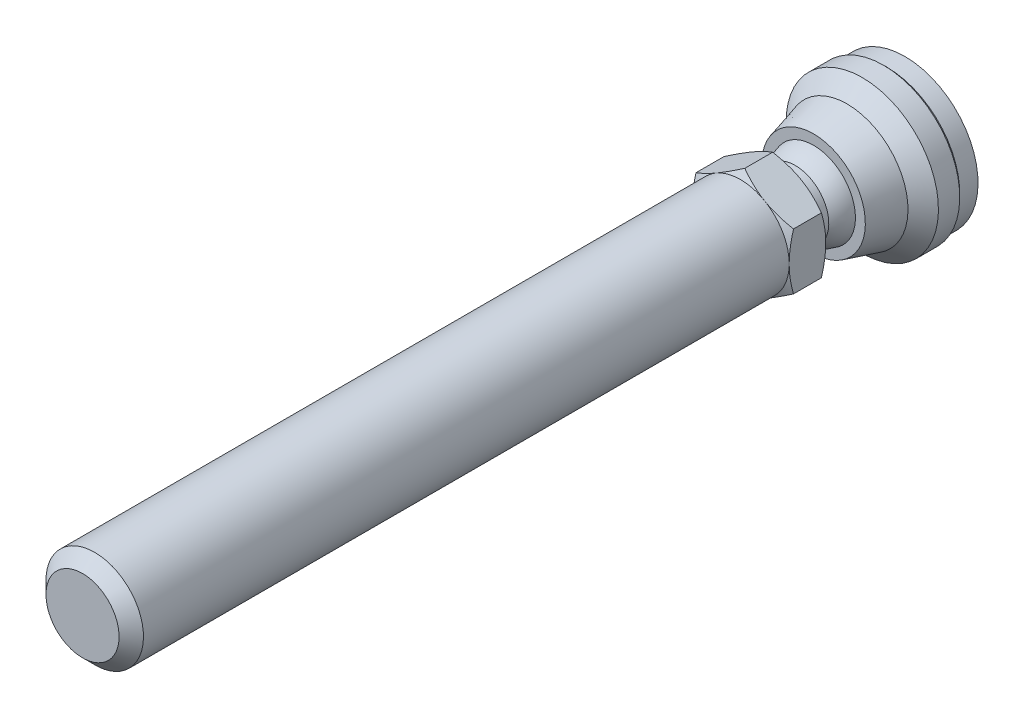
ISO-10303-21;
HEADER;
FILE_DESCRIPTION(('STEP AP214'),'2;1');
FILE_NAME('part.step','',(''),(''),'','','');
FILE_SCHEMA(('AUTOMOTIVE_DESIGN { 1 0 10303 214 1 1 1 1 }'));
ENDSEC;
DATA;
#1=APPLICATION_CONTEXT('core data for automotive mechanical design processes');
#2=APPLICATION_PROTOCOL_DEFINITION('international standard','automotive_design',2000,#1);
#3=PRODUCT_CONTEXT('',#1,'mechanical');
#4=PRODUCT('Part','Part','',(#3));
#5=PRODUCT_RELATED_PRODUCT_CATEGORY('part','',(#4));
#6=PRODUCT_DEFINITION_FORMATION('','',#4);
#7=PRODUCT_DEFINITION_CONTEXT('part definition',#1,'design');
#8=PRODUCT_DEFINITION('design','',#6,#7);
#9=PRODUCT_DEFINITION_SHAPE('','',#8);
#10=(LENGTH_UNIT() NAMED_UNIT(*) SI_UNIT(.MILLI.,.METRE.));
#11=(NAMED_UNIT(*) PLANE_ANGLE_UNIT() SI_UNIT($,.RADIAN.));
#12=(NAMED_UNIT(*) SI_UNIT($,.STERADIAN.) SOLID_ANGLE_UNIT());
#13=UNCERTAINTY_MEASURE_WITH_UNIT(LENGTH_MEASURE(1.E-05),#10,'distance_accuracy_value','');
#14=(GEOMETRIC_REPRESENTATION_CONTEXT(3) GLOBAL_UNCERTAINTY_ASSIGNED_CONTEXT((#13)) GLOBAL_UNIT_ASSIGNED_CONTEXT((#10,
#11,#12)) REPRESENTATION_CONTEXT('',''));
#15=CARTESIAN_POINT('',(0.,0.,0.));
#16=DIRECTION('',(0.,0.,1.));
#17=DIRECTION('',(1.,0.,0.));
#18=AXIS2_PLACEMENT_3D('',#15,#16,#17);
#19=CARTESIAN_POINT('',(-7.76470588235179,0.,20.9999999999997));
#20=DIRECTION('',(0.,0.,1.));
#21=DIRECTION('',(0.,-1.,0.));
#22=AXIS2_PLACEMENT_3D('',#19,#20,#21);
#23=PLANE('',#22);
#24=CARTESIAN_POINT('',(0.,0.,20.9999999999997));
#25=DIRECTION('',(0.,0.,-1.));
#26=DIRECTION('',(0.,1.,0.));
#27=AXIS2_PLACEMENT_3D('',#24,#25,#26);
#28=CIRCLE('',#27,5.49999999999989);
#29=CARTESIAN_POINT('',(0.,5.49999999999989,20.9999999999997));
#30=VERTEX_POINT('',#29);
#31=EDGE_CURVE('E293',#30,#30,#28,.T.);
#32=ORIENTED_EDGE('',*,*,#31,.F.);
#33=EDGE_LOOP('',(#32));
#34=FACE_BOUND('',#33,.T.);
#35=CARTESIAN_POINT('',(0.,0.,20.9999999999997));
#36=DIRECTION('',(0.,0.,1.));
#37=DIRECTION('',(0.,-1.,0.));
#38=AXIS2_PLACEMENT_3D('',#35,#36,#37);
#39=CIRCLE('',#38,7.99999999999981);
#40=CARTESIAN_POINT('',(-4.,-6.92820323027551,20.9999999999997));
#41=VERTEX_POINT('',#40);
#42=CARTESIAN_POINT('',(4.,-6.92820323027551,20.9999999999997));
#43=VERTEX_POINT('',#42);
#44=EDGE_CURVE('E106',#41,#43,#39,.T.);
#45=ORIENTED_EDGE('',*,*,#44,.F.);
#46=CARTESIAN_POINT('',(-8.,0.,20.9999999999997));
#47=VERTEX_POINT('',#46);
#48=EDGE_CURVE('E117',#47,#41,#39,.T.);
#49=ORIENTED_EDGE('',*,*,#48,.F.);
#50=CARTESIAN_POINT('',(-4.,6.92820323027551,20.9999999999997));
#51=VERTEX_POINT('',#50);
#52=EDGE_CURVE('E416',#51,#47,#39,.T.);
#53=ORIENTED_EDGE('',*,*,#52,.F.);
#54=CARTESIAN_POINT('',(4.,6.92820323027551,20.9999999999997));
#55=VERTEX_POINT('',#54);
#56=EDGE_CURVE('E34',#55,#51,#39,.T.);
#57=ORIENTED_EDGE('',*,*,#56,.F.);
#58=CARTESIAN_POINT('',(8.,0.,20.9999999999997));
#59=VERTEX_POINT('',#58);
#60=EDGE_CURVE('E140',#59,#55,#39,.T.);
#61=ORIENTED_EDGE('',*,*,#60,.F.);
#62=EDGE_CURVE('E119',#43,#59,#39,.T.);
#63=ORIENTED_EDGE('',*,*,#62,.F.);
#64=EDGE_LOOP('',(#45,#49,#53,#57,#61,#63));
#65=FACE_BOUND('',#64,.T.);
#66=ADVANCED_FACE('F14',(#34,#65),#23,.F.);
#67=CARTESIAN_POINT('',(0.,0.,0.));
#68=DIRECTION('',(0.,0.,-1.));
#69=DIRECTION('',(0.,1.,0.));
#70=AXIS2_PLACEMENT_3D('',#67,#68,#69);
#71=CYLINDRICAL_SURFACE('',#70,5.4999999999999);
#72=CARTESIAN_POINT('',(0.,0.,18.));
#73=DIRECTION('',(0.,0.,-1.));
#74=DIRECTION('',(0.,1.,0.));
#75=AXIS2_PLACEMENT_3D('',#72,#73,#74);
#76=CIRCLE('',#75,5.4999999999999);
#77=CARTESIAN_POINT('',(-5.49999999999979,0.,18.));
#78=VERTEX_POINT('',#77);
#79=EDGE_CURVE('E298',#78,#78,#76,.T.);
#80=ORIENTED_EDGE('',*,*,#79,.F.);
#81=EDGE_LOOP('',(#80));
#82=FACE_BOUND('',#81,.T.);
#83=ORIENTED_EDGE('',*,*,#31,.T.);
#84=EDGE_LOOP('',(#83));
#85=FACE_BOUND('',#84,.T.);
#86=ADVANCED_FACE('F259',(#82,#85),#71,.T.);
#87=CARTESIAN_POINT('',(1.11022302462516E-13,0.,13.6698729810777));
#88=DIRECTION('',(0.,0.,-1.));
#89=DIRECTION('',(-1.,0.,0.));
#90=AXIS2_PLACEMENT_3D('',#87,#88,#89);
#91=SPHERICAL_SURFACE('',#90,7.);
#92=CARTESIAN_POINT('',(0.,0.,15.));
#93=DIRECTION('',(0.,0.,-1.));
#94=DIRECTION('',(0.,1.,0.));
#95=AXIS2_PLACEMENT_3D('',#92,#93,#94);
#96=CIRCLE('',#95,6.87246404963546);
#97=CARTESIAN_POINT('',(-6.87246404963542,0.,15.));
#98=VERTEX_POINT('',#97);
#99=EDGE_CURVE('E301',#98,#98,#96,.T.);
#100=CARTESIAN_POINT('',(-6.87246404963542,0.,15.));
#101=CARTESIAN_POINT('',(-6.86587210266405,0.,15.0340591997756));
#102=CARTESIAN_POINT('',(-6.8590269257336,0.,15.0680693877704));
#103=CARTESIAN_POINT('',(-6.84483171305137,0.,15.1359842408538));
#104=CARTESIAN_POINT('',(-6.83748167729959,0.,15.1698889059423));
#105=CARTESIAN_POINT('',(-6.8222783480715,0.,15.2375852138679));
#106=CARTESIAN_POINT('',(-6.81442505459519,0.,15.2713768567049));
#107=CARTESIAN_POINT('',(-6.79821695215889,0.,15.3388396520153));
#108=CARTESIAN_POINT('',(-6.78986214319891,0.,15.3725108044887));
#109=CARTESIAN_POINT('',(-6.77265285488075,0.,15.4397251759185));
#110=CARTESIAN_POINT('',(-6.76379837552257,0.,15.473268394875));
#111=CARTESIAN_POINT('',(-6.74559170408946,0.,15.5402194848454));
#112=CARTESIAN_POINT('',(-6.73623951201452,0.,15.5736273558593));
#113=CARTESIAN_POINT('',(-6.71703948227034,0.,15.6403003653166));
#114=CARTESIAN_POINT('',(-6.7071916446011,0.,15.67356550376));
#115=CARTESIAN_POINT('',(-6.68700250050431,0.,15.7399456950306));
#116=CARTESIAN_POINT('',(-6.67666119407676,0.,15.7730607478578));
#117=CARTESIAN_POINT('',(-6.65548739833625,0.,15.8391334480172));
#118=CARTESIAN_POINT('',(-6.64465490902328,0.,15.8720910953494));
#119=CARTESIAN_POINT('',(-6.62250114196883,0.,15.9378416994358));
#120=CARTESIAN_POINT('',(-6.61117986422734,0.,15.9706346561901));
#121=CARTESIAN_POINT('',(-6.58805102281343,0.,16.0360486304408));
#122=CARTESIAN_POINT('',(-6.57624345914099,0.,16.0686696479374));
#123=CARTESIAN_POINT('',(-6.55214465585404,0.,16.1337325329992));
#124=CARTESIAN_POINT('',(-6.53985341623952,0.,16.1661744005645));
#125=CARTESIAN_POINT('',(-6.51478997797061,0.,16.2308718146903));
#126=CARTESIAN_POINT('',(-6.50201777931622,0.,16.2631273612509));
#127=CARTESIAN_POINT('',(-6.47599524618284,0.,16.3274450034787));
#128=CARTESIAN_POINT('',(-6.46274491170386,0.,16.3595070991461));
#129=CARTESIAN_POINT('',(-6.43576903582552,0.,16.4234307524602));
#130=CARTESIAN_POINT('',(-6.42204349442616,0.,16.455292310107));
#131=CARTESIAN_POINT('',(-6.39412023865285,0.,16.5188078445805));
#132=CARTESIAN_POINT('',(-6.37992252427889,0.,16.5504618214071));
#133=CARTESIAN_POINT('',(-6.35105806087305,0.,16.6135551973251));
#134=CARTESIAN_POINT('',(-6.33639131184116,0.,16.6449945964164));
#135=CARTESIAN_POINT('',(-6.30659202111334,0.,16.7076518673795));
#136=CARTESIAN_POINT('',(-6.2914594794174,0.,16.7388697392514));
#137=CARTESIAN_POINT('',(-6.26073194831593,0.,16.8010770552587));
#138=CARTESIAN_POINT('',(-6.24513695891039,0.,16.8320664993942));
#139=CARTESIAN_POINT('',(-6.21348797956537,0.,16.8938101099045));
#140=CARTESIAN_POINT('',(-6.19743398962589,0.,16.9245642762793));
#141=CARTESIAN_POINT('',(-6.16487055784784,0.,16.9858305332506));
#142=CARTESIAN_POINT('',(-6.14836111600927,0.,17.016342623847));
#143=CARTESIAN_POINT('',(-6.11489042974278,0.,17.0771179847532));
#144=CARTESIAN_POINT('',(-6.09792918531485,0.,17.107381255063));
#145=CARTESIAN_POINT('',(-6.06355864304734,0.,17.1676522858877));
#146=CARTESIAN_POINT('',(-6.04614934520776,0.,17.1976600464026));
#147=CARTESIAN_POINT('',(-6.01088654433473,0.,17.2574134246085));
#148=CARTESIAN_POINT('',(-5.99303304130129,0.,17.2871590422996));
#149=CARTESIAN_POINT('',(-5.9568857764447,0.,17.3463815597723));
#150=CARTESIAN_POINT('',(-5.93859201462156,0.,17.3758584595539));
#151=CARTESIAN_POINT('',(-5.90156827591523,0.,17.4345370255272));
#152=CARTESIAN_POINT('',(-5.88283829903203,0.,17.4637386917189));
#153=CARTESIAN_POINT('',(-5.84494627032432,0.,17.5218603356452));
#154=CARTESIAN_POINT('',(-5.8257842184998,0.,17.5507803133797));
#155=CARTESIAN_POINT('',(-5.78703227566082,0.,17.6083321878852));
#156=CARTESIAN_POINT('',(-5.76744238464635,0.,17.6369640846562));
#157=CARTESIAN_POINT('',(-5.72783909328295,0.,17.6939334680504));
#158=CARTESIAN_POINT('',(-5.70782569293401,0.,17.7222709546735));
#159=CARTESIAN_POINT('',(-5.66737980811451,0.,17.778645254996));
#160=CARTESIAN_POINT('',(-5.64694732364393,0.,17.8066820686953));
#161=CARTESIAN_POINT('',(-5.60566778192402,0.,17.862448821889));
#162=CARTESIAN_POINT('',(-5.58482072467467,0.,17.8901787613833));
#163=CARTESIAN_POINT('',(-5.54271666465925,0.,17.9453256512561));
#164=CARTESIAN_POINT('',(-5.52145966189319,0.,17.9727426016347));
#165=CARTESIAN_POINT('',(-5.49999999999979,0.,18.));
#166=B_SPLINE_CURVE_WITH_KNOTS('',3,(#100,#101,#102,#103,#104,#105,#106,#107,#108,#109,#110,
#111,#112,#113,#114,#115,#116,#117,#118,#119,#120,#121,#122,#123,#124,#125,#126,#127,#128,#129,
#130,#131,#132,#133,#134,#135,#136,#137,#138,#139,#140,#141,#142,#143,#144,#145,#146,#147,#148,
#149,#150,#151,#152,#153,#154,#155,#156,#157,#158,#159,#160,#161,#162,#163,#164,#165),
.UNSPECIFIED.,.F.,.F.,(4,2,2,2,2,2,2,2,2,2,2,2,2,2,2,2,2,2,2,2,2,2,2,2,2,2,2,2,2,2,2,2,4),(0.,
0.104072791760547,0.208145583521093,0.31221837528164,0.416291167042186,0.520363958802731,
0.624436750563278,0.728509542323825,0.832582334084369,0.936655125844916,1.04072791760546,
1.14480070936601,1.24887350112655,1.3529462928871,1.45701908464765,1.56109187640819,
1.66516466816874,1.76923745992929,1.87331025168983,1.97738304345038,2.08145583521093,
2.18552862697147,2.28960141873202,2.39367421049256,2.49774700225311,2.60181979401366,
2.7058925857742,2.80996537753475,2.9140381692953,3.01811096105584,3.12218375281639,
3.22625654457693,3.33032933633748),.UNSPECIFIED.);
#167=EDGE_CURVE('BSEAM255',#98,#78,#166,.T.);
#168=ORIENTED_EDGE('',*,*,#99,.F.);
#169=ORIENTED_EDGE('',*,*,#79,.T.);
#170=ORIENTED_EDGE('',*,*,#167,.T.);
#171=ORIENTED_EDGE('',*,*,#167,.F.);
#172=EDGE_LOOP('',(#168,#170,#169,#171));
#173=FACE_BOUND('',#172,.T.);
#174=ADVANCED_FACE('F255',(#173),#91,.T.);
#175=CARTESIAN_POINT('',(-8.5,0.,15.));
#176=DIRECTION('',(0.,0.,-1.));
#177=DIRECTION('',(0.,1.,0.));
#178=AXIS2_PLACEMENT_3D('',#175,#176,#177);
#179=PLANE('',#178);
#180=CARTESIAN_POINT('',(0.,0.,15.));
#181=DIRECTION('',(0.,0.,-1.));
#182=DIRECTION('',(0.,1.,0.));
#183=AXIS2_PLACEMENT_3D('',#180,#181,#182);
#184=CIRCLE('',#183,8.5);
#185=CARTESIAN_POINT('',(0.,8.5,15.));
#186=VERTEX_POINT('',#185);
#187=EDGE_CURVE('E304',#186,#186,#184,.T.);
#188=ORIENTED_EDGE('',*,*,#187,.F.);
#189=EDGE_LOOP('',(#188));
#190=FACE_BOUND('',#189,.T.);
#191=ORIENTED_EDGE('',*,*,#99,.T.);
#192=EDGE_LOOP('',(#191));
#193=FACE_BOUND('',#192,.T.);
#194=ADVANCED_FACE('F251',(#190,#193),#179,.F.);
#195=CARTESIAN_POINT('',(0.,0.,15.));
#196=DIRECTION('',(0.,0.,-1.));
#197=DIRECTION('',(0.,1.,0.));
#198=AXIS2_PLACEMENT_3D('',#195,#196,#197);
#199=CONICAL_SURFACE('',#198,8.5,0.266252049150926);
#200=CARTESIAN_POINT('',(0.,0.,9.49999999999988));
#201=DIRECTION('',(0.,0.,-1.));
#202=DIRECTION('',(0.,1.,0.));
#203=AXIS2_PLACEMENT_3D('',#200,#201,#202);
#204=CIRCLE('',#203,10.);
#205=CARTESIAN_POINT('',(0.,10.,9.49999999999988));
#206=VERTEX_POINT('',#205);
#207=EDGE_CURVE('E307',#206,#206,#204,.T.);
#208=ORIENTED_EDGE('',*,*,#207,.F.);
#209=EDGE_LOOP('',(#208));
#210=FACE_BOUND('',#209,.T.);
#211=ORIENTED_EDGE('',*,*,#187,.T.);
#212=EDGE_LOOP('',(#211));
#213=FACE_BOUND('',#212,.T.);
#214=ADVANCED_FACE('F247',(#210,#213),#199,.T.);
#215=CARTESIAN_POINT('',(0.,0.,9.49999999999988));
#216=DIRECTION('',(0.,0.,-1.));
#217=DIRECTION('',(0.,1.,0.));
#218=AXIS2_PLACEMENT_3D('',#215,#216,#217);
#219=CONICAL_SURFACE('',#218,10.,0.785398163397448);
#220=CARTESIAN_POINT('',(0.,0.,6.99999999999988));
#221=DIRECTION('',(0.,0.,-1.));
#222=DIRECTION('',(0.,1.,0.));
#223=AXIS2_PLACEMENT_3D('',#220,#221,#222);
#224=CIRCLE('',#223,12.5);
#225=CARTESIAN_POINT('',(0.,12.5,6.99999999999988));
#226=VERTEX_POINT('',#225);
#227=EDGE_CURVE('E310',#226,#226,#224,.T.);
#228=ORIENTED_EDGE('',*,*,#227,.F.);
#229=EDGE_LOOP('',(#228));
#230=FACE_BOUND('',#229,.T.);
#231=ORIENTED_EDGE('',*,*,#207,.T.);
#232=EDGE_LOOP('',(#231));
#233=FACE_BOUND('',#232,.T.);
#234=ADVANCED_FACE('F243',(#230,#233),#219,.T.);
#235=CARTESIAN_POINT('',(0.,0.,0.));
#236=DIRECTION('',(0.,0.,-1.));
#237=DIRECTION('',(0.,1.,0.));
#238=AXIS2_PLACEMENT_3D('',#235,#236,#237);
#239=CYLINDRICAL_SURFACE('',#238,12.5);
#240=CARTESIAN_POINT('',(0.,0.,3.49999999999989));
#241=DIRECTION('',(0.,0.,-1.));
#242=DIRECTION('',(0.,1.,0.));
#243=AXIS2_PLACEMENT_3D('',#240,#241,#242);
#244=CIRCLE('',#243,12.5);
#245=CARTESIAN_POINT('',(0.,12.5,3.49999999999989));
#246=VERTEX_POINT('',#245);
#247=EDGE_CURVE('E313',#246,#246,#244,.T.);
#248=ORIENTED_EDGE('',*,*,#247,.F.);
#249=EDGE_LOOP('',(#248));
#250=FACE_BOUND('',#249,.T.);
#251=ORIENTED_EDGE('',*,*,#227,.T.);
#252=EDGE_LOOP('',(#251));
#253=FACE_BOUND('',#252,.T.);
#254=ADVANCED_FACE('F239',(#250,#253),#239,.T.);
#255=CARTESIAN_POINT('',(0.,0.,3.49999999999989));
#256=DIRECTION('',(0.,0.,1.));
#257=DIRECTION('',(0.,-1.,0.));
#258=AXIS2_PLACEMENT_3D('',#255,#256,#257);
#259=CONICAL_SURFACE('',#258,12.5,0.785398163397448);
#260=CARTESIAN_POINT('',(0.,0.,2.99999999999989));
#261=DIRECTION('',(0.,0.,-1.));
#262=DIRECTION('',(0.,1.,0.));
#263=AXIS2_PLACEMENT_3D('',#260,#261,#262);
#264=CIRCLE('',#263,12.);
#265=CARTESIAN_POINT('',(0.,12.,2.99999999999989));
#266=VERTEX_POINT('',#265);
#267=EDGE_CURVE('E316',#266,#266,#264,.T.);
#268=ORIENTED_EDGE('',*,*,#267,.F.);
#269=EDGE_LOOP('',(#268));
#270=FACE_BOUND('',#269,.T.);
#271=ORIENTED_EDGE('',*,*,#247,.T.);
#272=EDGE_LOOP('',(#271));
#273=FACE_BOUND('',#272,.T.);
#274=ADVANCED_FACE('F235',(#270,#273),#259,.T.);
#275=CARTESIAN_POINT('',(0.,0.,0.));
#276=DIRECTION('',(0.,0.,-1.));
#277=DIRECTION('',(0.,1.,0.));
#278=AXIS2_PLACEMENT_3D('',#275,#276,#277);
#279=CYLINDRICAL_SURFACE('',#278,12.);
#280=CARTESIAN_POINT('',(0.,0.,0.));
#281=DIRECTION('',(0.,0.,-1.));
#282=DIRECTION('',(0.,1.,0.));
#283=AXIS2_PLACEMENT_3D('',#280,#281,#282);
#284=CIRCLE('',#283,12.);
#285=CARTESIAN_POINT('',(0.,12.,0.));
#286=VERTEX_POINT('',#285);
#287=EDGE_CURVE('E319',#286,#286,#284,.T.);
#288=ORIENTED_EDGE('',*,*,#287,.F.);
#289=EDGE_LOOP('',(#288));
#290=FACE_BOUND('',#289,.T.);
#291=ORIENTED_EDGE('',*,*,#267,.T.);
#292=EDGE_LOOP('',(#291));
#293=FACE_BOUND('',#292,.T.);
#294=ADVANCED_FACE('F231',(#290,#293),#279,.T.);
#295=CARTESIAN_POINT('',(-12.,0.,0.));
#296=DIRECTION('',(0.,0.,1.));
#297=DIRECTION('',(0.,-1.,0.));
#298=AXIS2_PLACEMENT_3D('',#295,#296,#297);
#299=PLANE('',#298);
#300=ORIENTED_EDGE('',*,*,#287,.T.);
#301=EDGE_LOOP('',(#300));
#302=FACE_BOUND('',#301,.T.);
#303=ADVANCED_FACE('F163',(#302),#299,.F.);
#304=CARTESIAN_POINT('',(0.,0.,20.9999999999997));
#305=DIRECTION('',(0.,0.,1.));
#306=DIRECTION('',(0.,-1.,0.));
#307=AXIS2_PLACEMENT_3D('',#304,#305,#306);
#308=CONICAL_SURFACE('',#307,7.99999999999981,1.0471975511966);
#309=CARTESIAN_POINT('',(8.,12.3975008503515,24.8997663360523));
#310=CARTESIAN_POINT('',(8.,12.0481719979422,24.7303474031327));
#311=CARTESIAN_POINT('',(8.,11.6980402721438,24.5625555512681));
#312=CARTESIAN_POINT('',(8.,10.9957440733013,24.2311412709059));
#313=CARTESIAN_POINT('',(8.,10.6435792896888,24.0675195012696));
#314=CARTESIAN_POINT('',(8.,9.93497105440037,23.7445354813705));
#315=CARTESIAN_POINT('',(8.,9.57851474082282,23.5852013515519));
#316=CARTESIAN_POINT('',(8.,8.8627639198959,23.2730655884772));
#317=CARTESIAN_POINT('',(8.,8.50346954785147,23.1202636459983));
#318=CARTESIAN_POINT('',(8.,7.76989418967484,22.8181493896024));
#319=CARTESIAN_POINT('',(8.,7.39550191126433,22.6691058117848));
#320=CARTESIAN_POINT('',(8.,6.64233469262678,22.3823209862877));
#321=CARTESIAN_POINT('',(8.,6.26355926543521,22.2445810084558));
#322=CARTESIAN_POINT('',(8.,5.50173054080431,21.9840265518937));
#323=CARTESIAN_POINT('',(8.,5.11868771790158,21.8611817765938));
#324=CARTESIAN_POINT('',(8.,4.34712122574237,21.6343641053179));
#325=CARTESIAN_POINT('',(8.,3.9585993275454,21.5303852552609));
#326=CARTESIAN_POINT('',(8.,3.17795226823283,21.3468569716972));
#327=CARTESIAN_POINT('',(8.,2.78585914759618,21.2671749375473));
#328=CARTESIAN_POINT('',(8.,2.19415617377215,21.1693268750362));
#329=CARTESIAN_POINT('',(8.,1.99631332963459,21.1403220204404));
#330=CARTESIAN_POINT('',(8.,1.59964737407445,21.0901064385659));
#331=CARTESIAN_POINT('',(8.,1.40082435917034,21.0688949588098));
#332=CARTESIAN_POINT('',(8.,1.00505743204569,21.0349542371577));
#333=CARTESIAN_POINT('',(8.,0.808122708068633,21.0221182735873));
#334=CARTESIAN_POINT('',(8.,0.413887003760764,21.0047851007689));
#335=CARTESIAN_POINT('',(8.,0.2165860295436,21.0002877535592));
#336=CARTESIAN_POINT('',(8.,-0.178029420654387,20.9997390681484));
#337=CARTESIAN_POINT('',(8.,-0.375343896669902,21.0036877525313));
#338=CARTESIAN_POINT('',(8.,-0.769631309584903,21.0199347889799));
#339=CARTESIAN_POINT('',(8.,-0.966604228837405,21.0322335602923));
#340=CARTESIAN_POINT('',(8.,-1.44027955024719,21.0715897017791));
#341=CARTESIAN_POINT('',(8.,-1.71665837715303,21.1026250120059));
#342=CARTESIAN_POINT('',(8.,-2.26734562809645,21.1794395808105));
#343=CARTESIAN_POINT('',(8.,-2.54165376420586,21.225220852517));
#344=CARTESIAN_POINT('',(8.,-3.36117020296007,21.382254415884));
#345=CARTESIAN_POINT('',(8.,-3.90265998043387,21.5131672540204));
#346=CARTESIAN_POINT('',(8.,-4.71229296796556,21.7399390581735));
#347=CARTESIAN_POINT('',(8.,-4.98464223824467,21.8216430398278));
#348=CARTESIAN_POINT('',(8.,-5.52669526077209,21.9934780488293));
#349=CARTESIAN_POINT('',(8.,-5.79639899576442,22.0836091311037));
#350=CARTESIAN_POINT('',(8.,-6.33324664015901,22.2708571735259));
#351=CARTESIAN_POINT('',(8.,-6.6003913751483,22.3679717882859));
#352=CARTESIAN_POINT('',(8.,-7.13247175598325,22.5680501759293));
#353=CARTESIAN_POINT('',(8.,-7.39740742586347,22.6710138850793));
#354=CARTESIAN_POINT('',(8.,-8.0149484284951,22.917611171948));
#355=CARTESIAN_POINT('',(8.,-8.36677803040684,23.0631835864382));
#356=CARTESIAN_POINT('',(8.,-9.06750042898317,23.3612527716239));
#357=CARTESIAN_POINT('',(8.,-9.41639305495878,23.5137499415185));
#358=CARTESIAN_POINT('',(8.,-10.1117776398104,23.8243041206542));
#359=CARTESIAN_POINT('',(8.,-10.4582690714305,23.9823623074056));
#360=CARTESIAN_POINT('',(8.,-11.1491707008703,24.3029353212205));
#361=CARTESIAN_POINT('',(8.,-11.4935809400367,24.4654500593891));
#362=CARTESIAN_POINT('',(8.,-12.1810221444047,24.7942871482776));
#363=CARTESIAN_POINT('',(8.,-12.52405127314,24.9606133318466));
#364=CARTESIAN_POINT('',(8.,-13.2086378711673,25.29626997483));
#365=CARTESIAN_POINT('',(8.,-13.5501953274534,25.4656004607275));
#366=CARTESIAN_POINT('',(8.,-14.5729195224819,25.9772671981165));
#367=CARTESIAN_POINT('',(8.,-15.2522261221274,26.323321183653));
#368=CARTESIAN_POINT('',(8.,-16.5515944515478,26.9937357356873));
#369=CARTESIAN_POINT('',(8.,-17.1719418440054,27.3175450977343));
#370=CARTESIAN_POINT('',(8.,-18.4103111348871,27.9696275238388));
#371=CARTESIAN_POINT('',(7.99999999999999,-19.0283329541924,28.2979007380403));
#372=CARTESIAN_POINT('',(7.99999999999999,-20.2610597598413,28.9570542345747));
#373=CARTESIAN_POINT('',(7.99999999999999,-20.8757691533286,29.2879262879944));
#374=CARTESIAN_POINT('',(7.99999999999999,-22.1036961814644,29.9523497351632));
#375=CARTESIAN_POINT('',(8.,-22.7169138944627,30.285900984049));
#376=CARTESIAN_POINT('',(8.,-23.3295803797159,30.6204548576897));
#377=B_SPLINE_CURVE_WITH_KNOTS('',3,(#309,#310,#311,#312,#313,#314,#315,#316,#317,#318,#319,
#320,#321,#322,#323,#324,#325,#326,#327,#328,#329,#330,#331,#332,#333,#334,#335,#336,#337,#338,
#339,#340,#341,#342,#343,#344,#345,#346,#347,#348,#349,#350,#351,#352,#353,#354,#355,#356,#357,
#358,#359,#360,#361,#362,#363,#364,#365,#366,#367,#368,#369,#370,#371,#372,#373,#374,#375,#376),
.UNSPECIFIED.,.F.,.F.,(4,2,2,2,2,2,2,2,2,2,2,2,2,2,2,2,2,2,2,2,2,2,2,2,2,2,2,2,2,2,2,2,2,4),(0.,
1.16474633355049,2.32967556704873,3.50096254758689,4.6721940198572,5.88095772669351,
7.08985704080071,8.29625469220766,9.50227094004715,10.7015823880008,11.3013260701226,
11.9010118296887,12.4928988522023,13.0847760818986,13.6766548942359,14.2685634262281,
15.1024396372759,15.9364297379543,17.6053415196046,18.4582933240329,19.3112506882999,
20.163922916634,21.0165858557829,22.1587558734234,23.3009918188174,24.4434710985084,
25.5859276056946,26.729588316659,27.8732591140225,30.1603075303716,32.2596095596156,
34.3589823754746,36.4532760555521,38.5474572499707),.UNSPECIFIED.);
#378=CARTESIAN_POINT('',(8.,4.61880215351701,21.7145311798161));
#379=VERTEX_POINT('',#378);
#380=EDGE_CURVE('E141',#379,#59,#377,.T.);
#381=ORIENTED_EDGE('',*,*,#380,.T.);
#382=ORIENTED_EDGE('',*,*,#60,.T.);
#383=CARTESIAN_POINT('',(-0.00019999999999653,9.23771977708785,21.7145978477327));
#384=CARTESIAN_POINT('',(0.175648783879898,9.13619343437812,21.6559907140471));
#385=CARTESIAN_POINT('',(0.352153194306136,9.03428856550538,21.6000434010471));
#386=CARTESIAN_POINT('',(0.706595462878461,8.82965122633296,21.4942010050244));
#387=CARTESIAN_POINT('',(0.884533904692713,8.72691841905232,21.4443085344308));
#388=CARTESIAN_POINT('',(1.42119823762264,8.41707512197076,21.3046927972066));
#389=CARTESIAN_POINT('',(1.78204258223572,8.20874154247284,21.2252811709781));
#390=CARTESIAN_POINT('',(2.32203917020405,7.89697436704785,21.1321616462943));
#391=CARTESIAN_POINT('',(2.49957818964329,7.79447216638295,21.1056345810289));
#392=CARTESIAN_POINT('',(2.8554591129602,7.58900421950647,21.0611531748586));
#393=CARTESIAN_POINT('',(3.03380094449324,7.4860385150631,21.0431980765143));
#394=CARTESIAN_POINT('',(3.3907916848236,7.27992981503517,21.0163156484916));
#395=CARTESIAN_POINT('',(3.5694400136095,7.17678715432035,21.007378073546));
#396=CARTESIAN_POINT('',(3.92690170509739,6.97040655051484,20.9987223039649));
#397=CARTESIAN_POINT('',(4.10571506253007,6.86716861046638,20.9990038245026));
#398=CARTESIAN_POINT('',(4.44001336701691,6.67416139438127,21.0081450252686));
#399=CARTESIAN_POINT('',(4.59552190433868,6.58437849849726,21.0158896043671));
#400=CARTESIAN_POINT('',(4.90617476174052,6.40502298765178,21.0382011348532));
#401=CARTESIAN_POINT('',(5.06131905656,6.31545038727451,21.0527685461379));
#402=CARTESIAN_POINT('',(5.52615131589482,6.04707935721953,21.1063606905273));
#403=CARTESIAN_POINT('',(5.83501648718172,5.86875596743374,21.1552686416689));
#404=CARTESIAN_POINT('',(6.4560232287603,5.51021755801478,21.2775394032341));
#405=CARTESIAN_POINT('',(6.76808554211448,5.33004829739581,21.3514205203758));
#406=CARTESIAN_POINT('',(7.38755648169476,4.97239658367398,21.5191001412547));
#407=CARTESIAN_POINT('',(7.69497304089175,4.79490955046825,21.6128592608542));
#408=CARTESIAN_POINT('',(8.0002,4.61868668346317,21.7145978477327));
#409=B_SPLINE_CURVE_WITH_KNOTS('',3,(#383,#384,#385,#386,#387,#388,#389,#390,#391,#392,#393,
#394,#395,#396,#397,#398,#399,#400,#401,#402,#403,#404,#405,#406,#407,#408),.UNSPECIFIED.,.F.,
.F.,(4,2,2,2,2,2,2,2,2,2,2,2,4),(0.,0.633973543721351,1.26821965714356,2.53934712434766,
3.15934343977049,3.77928496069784,4.39852133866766,5.01773858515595,5.55680239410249,
6.09590254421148,7.17487077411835,8.27776850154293,9.37850115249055),.UNSPECIFIED.);
#410=EDGE_CURVE('E18',#55,#379,#409,.T.);
#411=ORIENTED_EDGE('',*,*,#410,.T.);
#412=EDGE_LOOP('',(#381,#382,#411));
#413=FACE_BOUND('',#412,.T.);
#414=ADVANCED_FACE('F158',(#413),#308,.T.);
#415=CARTESIAN_POINT('',(-8.0002,4.61868668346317,21.7145978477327));
#416=CARTESIAN_POINT('',(-7.82435121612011,4.7202130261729,21.6559907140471));
#417=CARTESIAN_POINT('',(-7.64784680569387,4.82211789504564,21.6000434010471));
#418=CARTESIAN_POINT('',(-7.29340453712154,5.02675523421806,21.4942010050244));
#419=CARTESIAN_POINT('',(-7.11546609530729,5.1294880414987,21.4443085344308));
#420=CARTESIAN_POINT('',(-6.57880176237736,5.43933133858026,21.3046927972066));
#421=CARTESIAN_POINT('',(-6.21795741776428,5.64766491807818,21.2252811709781));
#422=CARTESIAN_POINT('',(-5.67796082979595,5.95943209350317,21.1321616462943));
#423=CARTESIAN_POINT('',(-5.50042181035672,6.06193429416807,21.1056345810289));
#424=CARTESIAN_POINT('',(-5.14454088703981,6.26740224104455,21.0611531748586));
#425=CARTESIAN_POINT('',(-4.96619905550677,6.37036794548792,21.0431980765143));
#426=CARTESIAN_POINT('',(-4.60920831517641,6.57647664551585,21.0163156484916));
#427=CARTESIAN_POINT('',(-4.4305599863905,6.67961930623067,21.007378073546));
#428=CARTESIAN_POINT('',(-4.07309829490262,6.88599991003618,20.9987223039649));
#429=CARTESIAN_POINT('',(-3.89428493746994,6.98923785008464,20.9990038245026));
#430=CARTESIAN_POINT('',(-3.5599866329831,7.18224506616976,21.0081450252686));
#431=CARTESIAN_POINT('',(-3.40447809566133,7.27202796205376,21.0158896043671));
#432=CARTESIAN_POINT('',(-3.09382523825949,7.45138347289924,21.0382011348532));
#433=CARTESIAN_POINT('',(-2.93868094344,7.54095607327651,21.0527685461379));
#434=CARTESIAN_POINT('',(-2.47384868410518,7.80932710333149,21.1063606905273));
#435=CARTESIAN_POINT('',(-2.16498351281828,7.98765049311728,21.1552686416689));
#436=CARTESIAN_POINT('',(-1.5439767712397,8.34618890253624,21.2775394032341));
#437=CARTESIAN_POINT('',(-1.23191445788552,8.52635816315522,21.3514205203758));
#438=CARTESIAN_POINT('',(-0.612443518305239,8.88400987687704,21.5191001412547));
#439=CARTESIAN_POINT('',(-0.305026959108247,9.06149691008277,21.6128592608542));
#440=CARTESIAN_POINT('',(0.000200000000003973,9.23771977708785,21.7145978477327));
#441=B_SPLINE_CURVE_WITH_KNOTS('',3,(#415,#416,#417,#418,#419,#420,#421,#422,#423,#424,#425,
#426,#427,#428,#429,#430,#431,#432,#433,#434,#435,#436,#437,#438,#439,#440),.UNSPECIFIED.,.F.,
.F.,(4,2,2,2,2,2,2,2,2,2,2,2,4),(0.,0.633973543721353,1.26821965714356,2.53934712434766,
3.15934343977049,3.77928496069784,4.39852133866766,5.01773858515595,5.55680239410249,
6.09590254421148,7.17487077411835,8.27776850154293,9.37850115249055),.UNSPECIFIED.);
#442=CARTESIAN_POINT('',(0.,9.23760430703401,21.7145311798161));
#443=VERTEX_POINT('',#442);
#444=EDGE_CURVE('E142',#51,#443,#441,.T.);
#445=ORIENTED_EDGE('',*,*,#444,.T.);
#446=EDGE_CURVE('E9',#443,#55,#409,.T.);
#447=ORIENTED_EDGE('',*,*,#446,.T.);
#448=ORIENTED_EDGE('',*,*,#56,.T.);
#449=EDGE_LOOP('',(#445,#447,#448));
#450=FACE_BOUND('',#449,.T.);
#451=ADVANCED_FACE('F162',(#450),#308,.T.);
#452=CARTESIAN_POINT('',(8.0002,-4.61868668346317,21.7145978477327));
#453=CARTESIAN_POINT('',(7.82435121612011,-4.7202130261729,21.6559907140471));
#454=CARTESIAN_POINT('',(7.64784680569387,-4.82211789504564,21.6000434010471));
#455=CARTESIAN_POINT('',(7.29340453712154,-5.02675523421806,21.4942010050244));
#456=CARTESIAN_POINT('',(7.11546609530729,-5.1294880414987,21.4443085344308));
#457=CARTESIAN_POINT('',(6.57880176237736,-5.43933133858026,21.3046927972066));
#458=CARTESIAN_POINT('',(6.21795741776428,-5.64766491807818,21.2252811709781));
#459=CARTESIAN_POINT('',(5.67796082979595,-5.95943209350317,21.1321616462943));
#460=CARTESIAN_POINT('',(5.50042181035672,-6.06193429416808,21.1056345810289));
#461=CARTESIAN_POINT('',(5.1445408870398,-6.26740224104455,21.0611531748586));
#462=CARTESIAN_POINT('',(4.96619905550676,-6.37036794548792,21.0431980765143));
#463=CARTESIAN_POINT('',(4.60920831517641,-6.57647664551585,21.0163156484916));
#464=CARTESIAN_POINT('',(4.4305599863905,-6.67961930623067,21.007378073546));
#465=CARTESIAN_POINT('',(4.07309829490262,-6.88599991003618,20.9987223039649));
#466=CARTESIAN_POINT('',(3.89428493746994,-6.98923785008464,20.9990038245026));
#467=CARTESIAN_POINT('',(3.5599866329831,-7.18224506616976,21.0081450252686));
#468=CARTESIAN_POINT('',(3.40447809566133,-7.27202796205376,21.0158896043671));
#469=CARTESIAN_POINT('',(3.09382523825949,-7.45138347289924,21.0382011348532));
#470=CARTESIAN_POINT('',(2.93868094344,-7.54095607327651,21.0527685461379));
#471=CARTESIAN_POINT('',(2.47384868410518,-7.80932710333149,21.1063606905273));
#472=CARTESIAN_POINT('',(2.16498351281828,-7.98765049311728,21.1552686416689));
#473=CARTESIAN_POINT('',(1.5439767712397,-8.34618890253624,21.2775394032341));
#474=CARTESIAN_POINT('',(1.23191445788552,-8.52635816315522,21.3514205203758));
#475=CARTESIAN_POINT('',(0.612443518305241,-8.88400987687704,21.5191001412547));
#476=CARTESIAN_POINT('',(0.305026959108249,-9.06149691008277,21.6128592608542));
#477=CARTESIAN_POINT('',(-0.000200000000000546,-9.23771977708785,21.7145978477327));
#478=B_SPLINE_CURVE_WITH_KNOTS('',3,(#452,#453,#454,#455,#456,#457,#458,#459,#460,#461,#462,
#463,#464,#465,#466,#467,#468,#469,#470,#471,#472,#473,#474,#475,#476,#477),.UNSPECIFIED.,.F.,
.F.,(4,2,2,2,2,2,2,2,2,2,2,2,4),(0.,0.633973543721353,1.26821965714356,2.53934712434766,
3.15934343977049,3.77928496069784,4.39852133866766,5.01773858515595,5.55680239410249,
6.09590254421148,7.17487077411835,8.27776850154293,9.37850115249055),.UNSPECIFIED.);
#479=CARTESIAN_POINT('',(8.,-4.61880215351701,21.7145311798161));
#480=VERTEX_POINT('',#479);
#481=EDGE_CURVE('E122',#480,#43,#478,.T.);
#482=ORIENTED_EDGE('',*,*,#481,.T.);
#483=ORIENTED_EDGE('',*,*,#62,.T.);
#484=EDGE_CURVE('E126',#59,#480,#377,.T.);
#485=ORIENTED_EDGE('',*,*,#484,.T.);
#486=EDGE_LOOP('',(#482,#483,#485));
#487=FACE_BOUND('',#486,.T.);
#488=ADVANCED_FACE('F123',(#487),#308,.T.);
#489=CARTESIAN_POINT('',(0.000200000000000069,-9.23771977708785,21.7145978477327));
#490=CARTESIAN_POINT('',(-0.175648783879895,-9.13619343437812,21.6559907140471));
#491=CARTESIAN_POINT('',(-0.352153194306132,-9.03428856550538,21.6000434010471));
#492=CARTESIAN_POINT('',(-0.706595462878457,-8.82965122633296,21.4942010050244));
#493=CARTESIAN_POINT('',(-0.884533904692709,-8.72691841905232,21.4443085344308));
#494=CARTESIAN_POINT('',(-1.42119823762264,-8.41707512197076,21.3046927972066));
#495=CARTESIAN_POINT('',(-1.78204258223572,-8.20874154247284,21.2252811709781));
#496=CARTESIAN_POINT('',(-2.32203917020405,-7.89697436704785,21.1321616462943));
#497=CARTESIAN_POINT('',(-2.49957818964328,-7.79447216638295,21.1056345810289));
#498=CARTESIAN_POINT('',(-2.8554591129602,-7.58900421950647,21.0611531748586));
#499=CARTESIAN_POINT('',(-3.03380094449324,-7.4860385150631,21.0431980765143));
#500=CARTESIAN_POINT('',(-3.39079168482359,-7.27992981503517,21.0163156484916));
#501=CARTESIAN_POINT('',(-3.5694400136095,-7.17678715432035,21.007378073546));
#502=CARTESIAN_POINT('',(-3.92690170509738,-6.97040655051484,20.9987223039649));
#503=CARTESIAN_POINT('',(-4.10571506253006,-6.86716861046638,20.9990038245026));
#504=CARTESIAN_POINT('',(-4.4400133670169,-6.67416139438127,21.0081450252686));
#505=CARTESIAN_POINT('',(-4.59552190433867,-6.58437849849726,21.0158896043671));
#506=CARTESIAN_POINT('',(-4.90617476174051,-6.40502298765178,21.0382011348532));
#507=CARTESIAN_POINT('',(-5.06131905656,-6.31545038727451,21.0527685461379));
#508=CARTESIAN_POINT('',(-5.52615131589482,-6.04707935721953,21.1063606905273));
#509=CARTESIAN_POINT('',(-5.83501648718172,-5.86875596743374,21.1552686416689));
#510=CARTESIAN_POINT('',(-6.4560232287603,-5.51021755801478,21.2775394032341));
#511=CARTESIAN_POINT('',(-6.76808554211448,-5.3300482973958,21.3514205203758));
#512=CARTESIAN_POINT('',(-7.38755648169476,-4.97239658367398,21.5191001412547));
#513=CARTESIAN_POINT('',(-7.69497304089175,-4.79490955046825,21.6128592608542));
#514=CARTESIAN_POINT('',(-8.0002,-4.61868668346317,21.7145978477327));
#515=B_SPLINE_CURVE_WITH_KNOTS('',3,(#489,#490,#491,#492,#493,#494,#495,#496,#497,#498,#499,
#500,#501,#502,#503,#504,#505,#506,#507,#508,#509,#510,#511,#512,#513,#514),.UNSPECIFIED.,.F.,
.F.,(4,2,2,2,2,2,2,2,2,2,2,2,4),(0.,0.633973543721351,1.26821965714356,2.53934712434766,
3.15934343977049,3.77928496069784,4.39852133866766,5.01773858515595,5.55680239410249,
6.09590254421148,7.17487077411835,8.27776850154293,9.37850115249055),.UNSPECIFIED.);
#516=CARTESIAN_POINT('',(0.,-9.23760430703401,21.7145311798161));
#517=VERTEX_POINT('',#516);
#518=EDGE_CURVE('E112',#517,#41,#515,.T.);
#519=ORIENTED_EDGE('',*,*,#518,.T.);
#520=ORIENTED_EDGE('',*,*,#44,.T.);
#521=EDGE_CURVE('E110',#43,#517,#478,.T.);
#522=ORIENTED_EDGE('',*,*,#521,.T.);
#523=EDGE_LOOP('',(#519,#520,#522));
#524=FACE_BOUND('',#523,.T.);
#525=ADVANCED_FACE('F108',(#524),#308,.T.);
#526=CARTESIAN_POINT('',(-8.,-4.618802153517,21.7145311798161));
#527=VERTEX_POINT('',#526);
#528=EDGE_CURVE('E137',#41,#527,#515,.T.);
#529=ORIENTED_EDGE('',*,*,#528,.T.);
#530=CARTESIAN_POINT('',(-8.,12.3975008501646,24.8997663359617));
#531=CARTESIAN_POINT('',(-8.,12.0481719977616,24.7303474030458));
#532=CARTESIAN_POINT('',(-8.,11.6980402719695,24.5625555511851));
#533=CARTESIAN_POINT('',(-8.,10.9957440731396,24.2311412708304));
#534=CARTESIAN_POINT('',(-8.,10.6435792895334,24.0675195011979));
#535=CARTESIAN_POINT('',(-8.,9.93497105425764,23.7445354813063));
#536=CARTESIAN_POINT('',(-8.,9.57851474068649,23.5852013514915));
#537=CARTESIAN_POINT('',(-8.,8.86276391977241,23.2730655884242));
#538=CARTESIAN_POINT('',(-8.,8.50346954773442,23.1202636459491));
#539=CARTESIAN_POINT('',(-8.,7.76989418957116,22.8181493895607));
#540=CARTESIAN_POINT('',(-8.,7.39550191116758,22.6691058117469));
#541=CARTESIAN_POINT('',(-8.,6.64233469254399,22.3823209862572));
#542=CARTESIAN_POINT('',(-8.,6.26355926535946,22.2445810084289));
#543=CARTESIAN_POINT('',(-8.,5.50173054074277,21.9840265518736));
#544=CARTESIAN_POINT('',(-8.,5.11868771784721,21.861181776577));
#545=CARTESIAN_POINT('',(-8.,4.34712122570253,21.6343641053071));
#546=CARTESIAN_POINT('',(-8.,3.95859932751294,21.5303852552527));
#547=CARTESIAN_POINT('',(-8.,3.17795226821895,21.3468569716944));
#548=CARTESIAN_POINT('',(-8.,2.78585914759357,21.2671749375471));
#549=CARTESIAN_POINT('',(-8.,2.19415617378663,21.1693268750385));
#550=CARTESIAN_POINT('',(-8.,1.9963133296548,21.1403220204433));
#551=CARTESIAN_POINT('',(-8.,1.59964737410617,21.0901064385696));
#552=CARTESIAN_POINT('',(-8.,1.40082435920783,21.0688949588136));
#553=CARTESIAN_POINT('',(-8.,1.00505743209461,21.0349542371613));
#554=CARTESIAN_POINT('',(-8.,0.808122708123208,21.0221182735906));
#555=CARTESIAN_POINT('',(-8.,0.413887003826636,21.004785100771));
#556=CARTESIAN_POINT('',(-8.,0.216586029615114,21.0002877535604));
#557=CARTESIAN_POINT('',(-8.,-0.178029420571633,20.9997390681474));
#558=CARTESIAN_POINT('',(-8.,-0.375343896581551,21.003687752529));
#559=CARTESIAN_POINT('',(-8.,-0.769631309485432,21.0199347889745));
#560=CARTESIAN_POINT('',(-8.,-0.966604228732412,21.0322335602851));
#561=CARTESIAN_POINT('',(-8.,-1.44027955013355,21.0715897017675));
#562=CARTESIAN_POINT('',(-8.,-1.71665837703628,21.1026250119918));
#563=CARTESIAN_POINT('',(-8.,-2.26734562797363,21.1794395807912));
#564=CARTESIAN_POINT('',(-8.,-2.54165376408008,21.225220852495));
#565=CARTESIAN_POINT('',(-8.,-3.36117020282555,21.3822544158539));
#566=CARTESIAN_POINT('',(-8.,-3.90265998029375,21.5131672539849));
#567=CARTESIAN_POINT('',(-8.,-4.71229296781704,21.73993905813));
#568=CARTESIAN_POINT('',(-8.,-4.9846422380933,21.8216430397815));
#569=CARTESIAN_POINT('',(-8.,-5.52669526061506,21.9934780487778));
#570=CARTESIAN_POINT('',(-8.,-5.79639899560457,22.0836091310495));
#571=CARTESIAN_POINT('',(-8.,-6.33324663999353,22.2708571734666));
#572=CARTESIAN_POINT('',(-8.,-6.60039137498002,22.3679717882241));
#573=CARTESIAN_POINT('',(-8.,-7.13247175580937,22.5680501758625));
#574=CARTESIAN_POINT('',(-8.,-7.39740742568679,22.67101388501));
#575=CARTESIAN_POINT('',(-8.,-8.01494842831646,22.9176111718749));
#576=CARTESIAN_POINT('',(-8.,-8.36677803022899,23.063183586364));
#577=CARTESIAN_POINT('',(-8.,-9.06750042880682,23.3612527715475));
#578=CARTESIAN_POINT('',(-8.,-9.41639305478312,23.5137499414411));
#579=CARTESIAN_POINT('',(-8.,-10.1117776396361,23.8243041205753));
#580=CARTESIAN_POINT('',(-8.,-10.4582690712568,23.9823623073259));
#581=CARTESIAN_POINT('',(-8.,-11.1491707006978,24.3029353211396));
#582=CARTESIAN_POINT('',(-8.,-11.4935809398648,24.4654500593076));
#583=CARTESIAN_POINT('',(-8.,-12.1810221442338,24.7942871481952));
#584=CARTESIAN_POINT('',(-8.,-12.5240512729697,24.9606133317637));
#585=CARTESIAN_POINT('',(-8.,-13.208637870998,25.2962699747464));
#586=CARTESIAN_POINT('',(-8.,-13.5501953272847,25.4656004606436));
#587=CARTESIAN_POINT('',(-8.,-14.5729195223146,25.9772671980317));
#588=CARTESIAN_POINT('',(-8.,-15.2522261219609,26.3233211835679));
#589=CARTESIAN_POINT('',(-8.,-16.5515944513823,26.9937357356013));
#590=CARTESIAN_POINT('',(-8.,-17.17194184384,27.3175450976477));
#591=CARTESIAN_POINT('',(-8.,-18.410311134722,27.9696275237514));
#592=CARTESIAN_POINT('',(-8.,-19.0283329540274,28.2979007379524));
#593=CARTESIAN_POINT('',(-8.,-20.2610597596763,28.9570542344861));
#594=CARTESIAN_POINT('',(-8.,-20.8757691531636,29.2879262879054));
#595=CARTESIAN_POINT('',(-8.,-22.1036961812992,29.9523497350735));
#596=CARTESIAN_POINT('',(-8.,-22.7169138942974,30.285900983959));
#597=CARTESIAN_POINT('',(-8.,-23.3295803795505,30.6204548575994));
#598=B_SPLINE_CURVE_WITH_KNOTS('',3,(#530,#531,#532,#533,#534,#535,#536,#537,#538,#539,#540,
#541,#542,#543,#544,#545,#546,#547,#548,#549,#550,#551,#552,#553,#554,#555,#556,#557,#558,#559,
#560,#561,#562,#563,#564,#565,#566,#567,#568,#569,#570,#571,#572,#573,#574,#575,#576,#577,#578,
#579,#580,#581,#582,#583,#584,#585,#586,#587,#588,#589,#590,#591,#592,#593,#594,#595,#596,#597),
.UNSPECIFIED.,.F.,.F.,(4,2,2,2,2,2,2,2,2,2,2,2,2,2,2,2,2,2,2,2,2,2,2,2,2,2,2,2,2,2,2,2,2,4),(0.,
1.16474633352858,2.32967556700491,3.50096254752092,4.67219401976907,5.88095772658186,
7.08985704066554,8.29625469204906,9.50227093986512,10.7015823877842,11.3013260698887,
11.9010118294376,12.4928988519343,13.0847760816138,13.6766548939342,14.2685634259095,
15.1024396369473,15.9364297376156,17.6053415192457,18.4582933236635,19.31125068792,
20.1639229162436,21.016585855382,22.1587558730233,23.3009918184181,24.4434710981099,
25.5859276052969,26.7295883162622,27.8732591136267,30.1603075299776,32.2596095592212,
34.3589823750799,36.4532760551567,38.5474572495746),.UNSPECIFIED.);
#599=EDGE_CURVE('E138',#527,#47,#598,.F.);
#600=ORIENTED_EDGE('',*,*,#599,.T.);
#601=ORIENTED_EDGE('',*,*,#48,.T.);
#602=EDGE_LOOP('',(#529,#600,#601));
#603=FACE_BOUND('',#602,.T.);
#604=ADVANCED_FACE('F415',(#603),#308,.T.);
#605=CARTESIAN_POINT('',(-8.,4.61880215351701,21.7145311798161));
#606=VERTEX_POINT('',#605);
#607=EDGE_CURVE('E130',#47,#606,#598,.F.);
#608=ORIENTED_EDGE('',*,*,#607,.T.);
#609=EDGE_CURVE('E345',#606,#51,#441,.T.);
#610=ORIENTED_EDGE('',*,*,#609,.T.);
#611=ORIENTED_EDGE('',*,*,#52,.T.);
#612=EDGE_LOOP('',(#608,#610,#611));
#613=FACE_BOUND('',#612,.T.);
#614=ADVANCED_FACE('F279',(#613),#308,.T.);
#615=CARTESIAN_POINT('',(-5.99999999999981,0.,135.));
#616=DIRECTION('',(0.,0.,-1.));
#617=DIRECTION('',(0.,1.,0.));
#618=AXIS2_PLACEMENT_3D('',#615,#616,#617);
#619=PLANE('',#618);
#620=CARTESIAN_POINT('',(0.,0.,135.));
#621=DIRECTION('',(0.,0.,-1.));
#622=DIRECTION('',(0.,1.,0.));
#623=AXIS2_PLACEMENT_3D('',#620,#621,#622);
#624=CIRCLE('',#623,5.99999999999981);
#625=CARTESIAN_POINT('',(0.,5.99999999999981,135.));
#626=VERTEX_POINT('',#625);
#627=EDGE_CURVE('E287',#626,#626,#624,.T.);
#628=ORIENTED_EDGE('',*,*,#627,.F.);
#629=EDGE_LOOP('',(#628));
#630=FACE_BOUND('',#629,.T.);
#631=ADVANCED_FACE('F16',(#630),#619,.F.);
#632=CARTESIAN_POINT('',(0.,0.,135.));
#633=DIRECTION('',(0.,0.,-1.));
#634=DIRECTION('',(0.,1.,0.));
#635=AXIS2_PLACEMENT_3D('',#632,#633,#634);
#636=CONICAL_SURFACE('',#635,5.99999999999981,0.785398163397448);
#637=CARTESIAN_POINT('',(0.,0.,133.));
#638=DIRECTION('',(0.,0.,-1.));
#639=DIRECTION('',(0.,1.,0.));
#640=AXIS2_PLACEMENT_3D('',#637,#638,#639);
#641=CIRCLE('',#640,7.99999999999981);
#642=CARTESIAN_POINT('',(0.,7.99999999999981,133.));
#643=VERTEX_POINT('',#642);
#644=EDGE_CURVE('E284',#643,#643,#641,.T.);
#645=ORIENTED_EDGE('',*,*,#644,.F.);
#646=EDGE_LOOP('',(#645));
#647=FACE_BOUND('',#646,.T.);
#648=ORIENTED_EDGE('',*,*,#627,.T.);
#649=EDGE_LOOP('',(#648));
#650=FACE_BOUND('',#649,.T.);
#651=ADVANCED_FACE('F270',(#647,#650),#636,.T.);
#652=CARTESIAN_POINT('',(0.,0.,0.));
#653=DIRECTION('',(0.,0.,-1.));
#654=DIRECTION('',(0.,1.,0.));
#655=AXIS2_PLACEMENT_3D('',#652,#653,#654);
#656=CYLINDRICAL_SURFACE('',#655,7.99999999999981);
#657=ORIENTED_EDGE('',*,*,#644,.T.);
#658=EDGE_LOOP('',(#657));
#659=FACE_BOUND('',#658,.T.);
#660=CARTESIAN_POINT('',(0.,0.,26.9999999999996));
#661=DIRECTION('',(0.,0.,-1.));
#662=DIRECTION('',(0.,1.,0.));
#663=AXIS2_PLACEMENT_3D('',#660,#661,#662);
#664=CIRCLE('',#663,7.99999999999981);
#665=CARTESIAN_POINT('',(4.,6.92820323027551,26.9999999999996));
#666=VERTEX_POINT('',#665);
#667=CARTESIAN_POINT('',(7.99999999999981,0.,26.9999999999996));
#668=VERTEX_POINT('',#667);
#669=EDGE_CURVE('E292',#666,#668,#664,.T.);
#670=ORIENTED_EDGE('',*,*,#669,.F.);
#671=CARTESIAN_POINT('',(-3.99999999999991,6.92820323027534,26.9999999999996));
#672=VERTEX_POINT('',#671);
#673=EDGE_CURVE('E288',#672,#666,#664,.T.);
#674=ORIENTED_EDGE('',*,*,#673,.F.);
#675=CARTESIAN_POINT('',(-7.99999999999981,0.,26.9999999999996));
#676=VERTEX_POINT('',#675);
#677=EDGE_CURVE('E291',#676,#672,#664,.T.);
#678=ORIENTED_EDGE('',*,*,#677,.F.);
#679=CARTESIAN_POINT('',(-3.99999999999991,-6.92820323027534,26.9999999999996));
#680=VERTEX_POINT('',#679);
#681=EDGE_CURVE('E363',#680,#676,#664,.T.);
#682=ORIENTED_EDGE('',*,*,#681,.F.);
#683=CARTESIAN_POINT('',(3.99999999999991,-6.92820323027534,26.9999999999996));
#684=VERTEX_POINT('',#683);
#685=EDGE_CURVE('E370',#684,#680,#664,.T.);
#686=ORIENTED_EDGE('',*,*,#685,.F.);
#687=CARTESIAN_POINT('',(0.,0.,26.9999999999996));
#688=DIRECTION('',(0.,0.,1.));
#689=DIRECTION('',(0.,-1.,0.));
#690=AXIS2_PLACEMENT_3D('',#687,#688,#689);
#691=CIRCLE('',#690,7.99999999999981);
#692=EDGE_CURVE('E367',#684,#668,#691,.T.);
#693=ORIENTED_EDGE('',*,*,#692,.T.);
#694=EDGE_LOOP('',(#670,#674,#678,#682,#686,#693));
#695=FACE_BOUND('',#694,.T.);
#696=ADVANCED_FACE('F267',(#659,#695),#656,.T.);
#697=CARTESIAN_POINT('',(0.,0.,25.2246063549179));
#698=DIRECTION('',(0.,0.,-1.));
#699=DIRECTION('',(0.,1.,0.));
#700=AXIS2_PLACEMENT_3D('',#697,#698,#699);
#701=CONICAL_SURFACE('',#700,11.0750719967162,1.0471975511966);
#702=CARTESIAN_POINT('',(0.000200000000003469,9.23771977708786,26.2854021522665));
#703=CARTESIAN_POINT('',(-0.175648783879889,9.13619343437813,26.3440092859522));
#704=CARTESIAN_POINT('',(-0.352153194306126,9.03428856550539,26.3999565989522));
#705=CARTESIAN_POINT('',(-0.706595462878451,8.82965122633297,26.5057989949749));
#706=CARTESIAN_POINT('',(-0.884533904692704,8.72691841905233,26.5556914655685));
#707=CARTESIAN_POINT('',(-1.42119823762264,8.41707512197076,26.6953072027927));
#708=CARTESIAN_POINT('',(-1.78204258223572,8.20874154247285,26.7747188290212));
#709=CARTESIAN_POINT('',(-2.32203917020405,7.89697436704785,26.8678383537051));
#710=CARTESIAN_POINT('',(-2.49957818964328,7.79447216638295,26.8943654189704));
#711=CARTESIAN_POINT('',(-2.8554591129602,7.58900421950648,26.9388468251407));
#712=CARTESIAN_POINT('',(-3.03380094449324,7.4860385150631,26.956801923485));
#713=CARTESIAN_POINT('',(-3.39079168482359,7.27992981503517,26.9836843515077));
#714=CARTESIAN_POINT('',(-3.5694400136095,7.17678715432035,26.9926219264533));
#715=CARTESIAN_POINT('',(-3.92690170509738,6.97040655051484,27.0012776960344));
#716=CARTESIAN_POINT('',(-4.10571506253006,6.86716861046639,27.0009961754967));
#717=CARTESIAN_POINT('',(-4.4400133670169,6.67416139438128,26.9918549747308));
#718=CARTESIAN_POINT('',(-4.59552190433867,6.58437849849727,26.9841103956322));
#719=CARTESIAN_POINT('',(-4.9061747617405,6.40502298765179,26.9617988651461));
#720=CARTESIAN_POINT('',(-5.06131905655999,6.31545038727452,26.9472314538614));
#721=CARTESIAN_POINT('',(-5.52615131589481,6.04707935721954,26.893639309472));
#722=CARTESIAN_POINT('',(-5.83501648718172,5.86875596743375,26.8447313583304));
#723=CARTESIAN_POINT('',(-6.4560232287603,5.51021755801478,26.7224605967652));
#724=CARTESIAN_POINT('',(-6.76808554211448,5.33004829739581,26.6485794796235));
#725=CARTESIAN_POINT('',(-7.38755648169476,4.97239658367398,26.4808998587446));
#726=CARTESIAN_POINT('',(-7.69497304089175,4.79490955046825,26.3871407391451));
#727=CARTESIAN_POINT('',(-8.0002,4.61868668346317,26.2854021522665));
#728=B_SPLINE_CURVE_WITH_KNOTS('',3,(#702,#703,#704,#705,#706,#707,#708,#709,#710,#711,#712,
#713,#714,#715,#716,#717,#718,#719,#720,#721,#722,#723,#724,#725,#726,#727),.UNSPECIFIED.,.F.,
.F.,(4,2,2,2,2,2,2,2,2,2,2,2,4),(0.,0.633973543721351,1.26821965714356,2.53934712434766,
3.1593434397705,3.77928496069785,4.39852133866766,5.01773858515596,5.55680239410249,
6.09590254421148,7.17487077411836,8.27776850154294,9.37850115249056),.UNSPECIFIED.);
#729=CARTESIAN_POINT('',(-8.,4.61880215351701,26.2854688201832));
#730=VERTEX_POINT('',#729);
#731=EDGE_CURVE('E213',#672,#730,#728,.T.);
#732=ORIENTED_EDGE('',*,*,#731,.T.);
#733=CARTESIAN_POINT('',(-8.,12.3975008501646,23.1002336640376));
#734=CARTESIAN_POINT('',(-8.,12.0481719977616,23.2696525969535));
#735=CARTESIAN_POINT('',(-8.,11.6980402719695,23.4374444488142));
#736=CARTESIAN_POINT('',(-8.,10.9957440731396,23.7688587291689));
#737=CARTESIAN_POINT('',(-8.,10.6435792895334,23.9324804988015));
#738=CARTESIAN_POINT('',(-8.,9.93497105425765,24.255464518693));
#739=CARTESIAN_POINT('',(-8.,9.57851474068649,24.4147986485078));
#740=CARTESIAN_POINT('',(-8.,8.86276391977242,24.7269344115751));
#741=CARTESIAN_POINT('',(-8.,8.50346954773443,24.8797363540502));
#742=CARTESIAN_POINT('',(-8.,7.76989418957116,25.1818506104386));
#743=CARTESIAN_POINT('',(-8.,7.39550191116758,25.3308941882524));
#744=CARTESIAN_POINT('',(-8.,6.64233469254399,25.6176790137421));
#745=CARTESIAN_POINT('',(-8.,6.26355926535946,25.7554189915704));
#746=CARTESIAN_POINT('',(-8.,5.50173054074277,26.0159734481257));
#747=CARTESIAN_POINT('',(-8.,5.11868771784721,26.1388182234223));
#748=CARTESIAN_POINT('',(-8.,4.34712122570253,26.3656358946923));
#749=CARTESIAN_POINT('',(-8.,3.95859932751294,26.4696147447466));
#750=CARTESIAN_POINT('',(-8.,3.17795226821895,26.6531430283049));
#751=CARTESIAN_POINT('',(-8.,2.78585914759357,26.7328250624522));
#752=CARTESIAN_POINT('',(-8.,2.19415617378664,26.8306731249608));
#753=CARTESIAN_POINT('',(-8.,1.9963133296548,26.859677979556));
#754=CARTESIAN_POINT('',(-8.,1.59964737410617,26.9098935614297));
#755=CARTESIAN_POINT('',(-8.,1.40082435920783,26.9311050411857));
#756=CARTESIAN_POINT('',(-8.,1.00505743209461,26.965045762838));
#757=CARTESIAN_POINT('',(-8.,0.80812270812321,26.9778817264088));
#758=CARTESIAN_POINT('',(-8.,0.413887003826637,26.9952148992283));
#759=CARTESIAN_POINT('',(-8.,0.216586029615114,26.9997122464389));
#760=CARTESIAN_POINT('',(-8.,-0.178029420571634,27.0002609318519));
#761=CARTESIAN_POINT('',(-8.,-0.375343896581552,26.9963122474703));
#762=CARTESIAN_POINT('',(-8.,-0.769631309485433,26.9800652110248));
#763=CARTESIAN_POINT('',(-8.,-0.966604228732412,26.9677664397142));
#764=CARTESIAN_POINT('',(-8.,-1.44027955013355,26.9284102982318));
#765=CARTESIAN_POINT('',(-8.,-1.71665837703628,26.8973749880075));
#766=CARTESIAN_POINT('',(-8.,-2.26734562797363,26.8205604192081));
#767=CARTESIAN_POINT('',(-8.,-2.54165376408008,26.7747791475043));
#768=CARTESIAN_POINT('',(-8.,-3.36117020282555,26.6177455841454));
#769=CARTESIAN_POINT('',(-8.,-3.90265998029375,26.4868327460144));
#770=CARTESIAN_POINT('',(-8.,-4.71229296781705,26.2600609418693));
#771=CARTESIAN_POINT('',(-8.,-4.98464223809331,26.1783569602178));
#772=CARTESIAN_POINT('',(-8.,-5.52669526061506,26.0065219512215));
#773=CARTESIAN_POINT('',(-8.,-5.79639899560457,25.9163908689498));
#774=CARTESIAN_POINT('',(-8.,-6.33324663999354,25.7291428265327));
#775=CARTESIAN_POINT('',(-8.,-6.60039137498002,25.6320282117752));
#776=CARTESIAN_POINT('',(-8.,-7.13247175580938,25.4319498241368));
#777=CARTESIAN_POINT('',(-8.,-7.39740742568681,25.3289861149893));
#778=CARTESIAN_POINT('',(-8.,-8.01494842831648,25.0823888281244));
#779=CARTESIAN_POINT('',(-8.,-8.36677803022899,24.9368164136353));
#780=CARTESIAN_POINT('',(-8.,-9.06750042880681,24.6387472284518));
#781=CARTESIAN_POINT('',(-8.,-9.41639305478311,24.4862500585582));
#782=CARTESIAN_POINT('',(-8.,-10.111777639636,24.175695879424));
#783=CARTESIAN_POINT('',(-8.,-10.4582690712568,24.0176376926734));
#784=CARTESIAN_POINT('',(-8.,-11.1491707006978,23.6970646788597));
#785=CARTESIAN_POINT('',(-8.,-11.4935809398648,23.5345499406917));
#786=CARTESIAN_POINT('',(-8.,-12.1810221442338,23.2057128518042));
#787=CARTESIAN_POINT('',(-8.,-12.5240512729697,23.0393866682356));
#788=CARTESIAN_POINT('',(-8.,-13.208637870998,22.7037300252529));
#789=CARTESIAN_POINT('',(-8.,-13.5501953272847,22.5343995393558));
#790=CARTESIAN_POINT('',(-8.,-14.5729195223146,22.0227328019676));
#791=CARTESIAN_POINT('',(-8.,-15.2522261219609,21.6766788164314));
#792=CARTESIAN_POINT('',(-8.,-16.5515944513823,21.0062642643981));
#793=CARTESIAN_POINT('',(-8.,-17.17194184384,20.6824549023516));
#794=CARTESIAN_POINT('',(-8.,-18.410311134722,20.0303724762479));
#795=CARTESIAN_POINT('',(-8.,-19.0283329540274,19.7020992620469));
#796=CARTESIAN_POINT('',(-8.,-20.2610597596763,19.0429457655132));
#797=CARTESIAN_POINT('',(-8.,-20.8757691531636,18.7120737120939));
#798=CARTESIAN_POINT('',(-8.,-22.1036961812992,18.0476502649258));
#799=CARTESIAN_POINT('',(-8.,-22.7169138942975,17.7140990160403));
#800=CARTESIAN_POINT('',(-8.,-23.3295803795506,17.3795451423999));
#801=B_SPLINE_CURVE_WITH_KNOTS('',3,(#733,#734,#735,#736,#737,#738,#739,#740,#741,#742,#743,
#744,#745,#746,#747,#748,#749,#750,#751,#752,#753,#754,#755,#756,#757,#758,#759,#760,#761,#762,
#763,#764,#765,#766,#767,#768,#769,#770,#771,#772,#773,#774,#775,#776,#777,#778,#779,#780,#781,
#782,#783,#784,#785,#786,#787,#788,#789,#790,#791,#792,#793,#794,#795,#796,#797,#798,#799,#800),
.UNSPECIFIED.,.F.,.F.,(4,2,2,2,2,2,2,2,2,2,2,2,2,2,2,2,2,2,2,2,2,2,2,2,2,2,2,2,2,2,2,2,2,4),(0.,
1.16474633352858,2.32967556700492,3.50096254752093,4.67219401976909,5.88095772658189,
7.08985704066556,8.29625469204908,9.50227093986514,10.7015823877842,11.3013260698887,
11.9010118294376,12.4928988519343,13.0847760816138,13.6766548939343,14.2685634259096,
15.1024396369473,15.9364297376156,17.6053415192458,18.4582933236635,19.31125068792,
20.1639229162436,21.016585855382,22.1587558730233,23.3009918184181,24.4434710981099,
25.5859276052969,26.7295883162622,27.8732591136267,30.1603075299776,32.2596095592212,
34.3589823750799,36.4532760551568,38.5474572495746),.UNSPECIFIED.);
#802=EDGE_CURVE('E205',#730,#676,#801,.T.);
#803=ORIENTED_EDGE('',*,*,#802,.T.);
#804=ORIENTED_EDGE('',*,*,#677,.T.);
#805=EDGE_LOOP('',(#732,#803,#804));
#806=FACE_BOUND('',#805,.T.);
#807=ADVANCED_FACE('F269',(#806),#701,.T.);
#808=CARTESIAN_POINT('',(-8.,-4.61880215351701,26.2854688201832));
#809=VERTEX_POINT('',#808);
#810=EDGE_CURVE('E198',#676,#809,#801,.T.);
#811=ORIENTED_EDGE('',*,*,#810,.T.);
#812=CARTESIAN_POINT('',(-8.0002,-4.61868668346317,26.2854021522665));
#813=CARTESIAN_POINT('',(-7.82435121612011,-4.72021302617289,26.3440092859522));
#814=CARTESIAN_POINT('',(-7.64784680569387,-4.82211789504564,26.3999565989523));
#815=CARTESIAN_POINT('',(-7.29340453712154,-5.02675523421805,26.5057989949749));
#816=CARTESIAN_POINT('',(-7.11546609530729,-5.12948804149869,26.5556914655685));
#817=CARTESIAN_POINT('',(-6.57880176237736,-5.43933133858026,26.6953072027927));
#818=CARTESIAN_POINT('',(-6.21795741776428,-5.64766491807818,26.7747188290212));
#819=CARTESIAN_POINT('',(-5.67796082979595,-5.95943209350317,26.8678383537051));
#820=CARTESIAN_POINT('',(-5.50042181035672,-6.06193429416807,26.8943654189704));
#821=CARTESIAN_POINT('',(-5.1445408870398,-6.26740224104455,26.9388468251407));
#822=CARTESIAN_POINT('',(-4.96619905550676,-6.37036794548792,26.956801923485));
#823=CARTESIAN_POINT('',(-4.60920831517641,-6.57647664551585,26.9836843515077));
#824=CARTESIAN_POINT('',(-4.4305599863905,-6.67961930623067,26.9926219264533));
#825=CARTESIAN_POINT('',(-4.07309829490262,-6.88599991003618,27.0012776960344));
#826=CARTESIAN_POINT('',(-3.89428493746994,-6.98923785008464,27.0009961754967));
#827=CARTESIAN_POINT('',(-3.5599866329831,-7.18224506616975,26.9918549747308));
#828=CARTESIAN_POINT('',(-3.40447809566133,-7.27202796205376,26.9841103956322));
#829=CARTESIAN_POINT('',(-3.09382523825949,-7.45138347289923,26.9617988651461));
#830=CARTESIAN_POINT('',(-2.93868094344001,-7.5409560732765,26.9472314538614));
#831=CARTESIAN_POINT('',(-2.47384868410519,-7.80932710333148,26.893639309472));
#832=CARTESIAN_POINT('',(-2.16498351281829,-7.98765049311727,26.8447313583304));
#833=CARTESIAN_POINT('',(-1.5439767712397,-8.34618890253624,26.7224605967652));
#834=CARTESIAN_POINT('',(-1.23191445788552,-8.52635816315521,26.6485794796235));
#835=CARTESIAN_POINT('',(-0.612443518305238,-8.88400987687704,26.4808998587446));
#836=CARTESIAN_POINT('',(-0.305026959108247,-9.06149691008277,26.3871407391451));
#837=CARTESIAN_POINT('',(0.000199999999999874,-9.23771977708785,26.2854021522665));
#838=B_SPLINE_CURVE_WITH_KNOTS('',3,(#812,#813,#814,#815,#816,#817,#818,#819,#820,#821,#822,
#823,#824,#825,#826,#827,#828,#829,#830,#831,#832,#833,#834,#835,#836,#837),.UNSPECIFIED.,.F.,
.F.,(4,2,2,2,2,2,2,2,2,2,2,2,4),(0.,0.633973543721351,1.26821965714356,2.53934712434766,
3.15934343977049,3.77928496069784,4.39852133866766,5.01773858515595,5.55680239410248,
6.09590254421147,7.17487077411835,8.27776850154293,9.37850115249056),.UNSPECIFIED.);
#839=EDGE_CURVE('E206',#809,#680,#838,.T.);
#840=ORIENTED_EDGE('',*,*,#839,.T.);
#841=ORIENTED_EDGE('',*,*,#681,.T.);
#842=EDGE_LOOP('',(#811,#840,#841));
#843=FACE_BOUND('',#842,.T.);
#844=ADVANCED_FACE('F375',(#843),#701,.T.);
#845=CARTESIAN_POINT('',(0.,-9.23760430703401,26.2854688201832));
#846=VERTEX_POINT('',#845);
#847=EDGE_CURVE('E207',#680,#846,#838,.T.);
#848=ORIENTED_EDGE('',*,*,#847,.T.);
#849=CARTESIAN_POINT('',(-0.000199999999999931,-9.23771977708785,26.2854021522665));
#850=CARTESIAN_POINT('',(0.175648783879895,-9.13619343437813,26.3440092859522));
#851=CARTESIAN_POINT('',(0.352153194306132,-9.03428856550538,26.3999565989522));
#852=CARTESIAN_POINT('',(0.706595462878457,-8.82965122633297,26.5057989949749));
#853=CARTESIAN_POINT('',(0.88453390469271,-8.72691841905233,26.5556914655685));
#854=CARTESIAN_POINT('',(1.42119823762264,-8.41707512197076,26.6953072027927));
#855=CARTESIAN_POINT('',(1.78204258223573,-8.20874154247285,26.7747188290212));
#856=CARTESIAN_POINT('',(2.32203917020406,-7.89697436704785,26.8678383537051));
#857=CARTESIAN_POINT('',(2.49957818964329,-7.79447216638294,26.8943654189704));
#858=CARTESIAN_POINT('',(2.8554591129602,-7.58900421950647,26.9388468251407));
#859=CARTESIAN_POINT('',(3.03380094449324,-7.4860385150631,26.956801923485));
#860=CARTESIAN_POINT('',(3.3907916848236,-7.27992981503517,26.9836843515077));
#861=CARTESIAN_POINT('',(3.56944001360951,-7.17678715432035,26.9926219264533));
#862=CARTESIAN_POINT('',(3.92690170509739,-6.97040655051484,27.0012776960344));
#863=CARTESIAN_POINT('',(4.10571506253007,-6.86716861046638,27.0009961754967));
#864=CARTESIAN_POINT('',(4.44001336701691,-6.67416139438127,26.9918549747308));
#865=CARTESIAN_POINT('',(4.59552190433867,-6.58437849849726,26.9841103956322));
#866=CARTESIAN_POINT('',(4.90617476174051,-6.40502298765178,26.9617988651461));
#867=CARTESIAN_POINT('',(5.06131905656,-6.31545038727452,26.9472314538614));
#868=CARTESIAN_POINT('',(5.52615131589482,-6.04707935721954,26.893639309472));
#869=CARTESIAN_POINT('',(5.83501648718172,-5.86875596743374,26.8447313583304));
#870=CARTESIAN_POINT('',(6.4560232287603,-5.51021755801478,26.7224605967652));
#871=CARTESIAN_POINT('',(6.76808554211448,-5.33004829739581,26.6485794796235));
#872=CARTESIAN_POINT('',(7.38755648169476,-4.97239658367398,26.4808998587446));
#873=CARTESIAN_POINT('',(7.69497304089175,-4.79490955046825,26.3871407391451));
#874=CARTESIAN_POINT('',(8.0002,-4.61868668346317,26.2854021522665));
#875=B_SPLINE_CURVE_WITH_KNOTS('',3,(#849,#850,#851,#852,#853,#854,#855,#856,#857,#858,#859,
#860,#861,#862,#863,#864,#865,#866,#867,#868,#869,#870,#871,#872,#873,#874),.UNSPECIFIED.,.F.,
.F.,(4,2,2,2,2,2,2,2,2,2,2,2,4),(0.,0.633973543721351,1.26821965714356,2.53934712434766,
3.1593434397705,3.77928496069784,4.39852133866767,5.01773858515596,5.55680239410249,
6.09590254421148,7.17487077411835,8.27776850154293,9.37850115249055),.UNSPECIFIED.);
#876=EDGE_CURVE('E378',#846,#684,#875,.T.);
#877=ORIENTED_EDGE('',*,*,#876,.T.);
#878=ORIENTED_EDGE('',*,*,#685,.T.);
#879=EDGE_LOOP('',(#848,#877,#878));
#880=FACE_BOUND('',#879,.T.);
#881=ADVANCED_FACE('F581',(#880),#701,.T.);
#882=CARTESIAN_POINT('',(8.,-4.61880215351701,26.2854688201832));
#883=VERTEX_POINT('',#882);
#884=EDGE_CURVE('E379',#684,#883,#875,.T.);
#885=ORIENTED_EDGE('',*,*,#884,.T.);
#886=CARTESIAN_POINT('',(8.,12.3975008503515,23.1002336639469));
#887=CARTESIAN_POINT('',(8.,12.0481719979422,23.2696525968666));
#888=CARTESIAN_POINT('',(8.,11.6980402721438,23.4374444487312));
#889=CARTESIAN_POINT('',(8.,10.9957440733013,23.7688587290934));
#890=CARTESIAN_POINT('',(8.,10.6435792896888,23.9324804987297));
#891=CARTESIAN_POINT('',(8.,9.93497105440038,24.2554645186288));
#892=CARTESIAN_POINT('',(8.,9.57851474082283,24.4147986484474));
#893=CARTESIAN_POINT('',(8.,8.8627639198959,24.7269344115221));
#894=CARTESIAN_POINT('',(8.,8.50346954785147,24.879736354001));
#895=CARTESIAN_POINT('',(8.,7.76989418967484,25.1818506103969));
#896=CARTESIAN_POINT('',(8.,7.39550191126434,25.3308941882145));
#897=CARTESIAN_POINT('',(8.,6.64233469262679,25.6176790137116));
#898=CARTESIAN_POINT('',(8.,6.26355926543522,25.7554189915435));
#899=CARTESIAN_POINT('',(8.,5.50173054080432,26.0159734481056));
#900=CARTESIAN_POINT('',(8.,5.11868771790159,26.1388182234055));
#901=CARTESIAN_POINT('',(8.,4.34712122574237,26.3656358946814));
#902=CARTESIAN_POINT('',(8.,3.9585993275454,26.4696147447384));
#903=CARTESIAN_POINT('',(8.,3.17795226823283,26.6531430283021));
#904=CARTESIAN_POINT('',(8.,2.78585914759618,26.732825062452));
#905=CARTESIAN_POINT('',(8.,2.19415617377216,26.8306731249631));
#906=CARTESIAN_POINT('',(8.,1.99631332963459,26.8596779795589));
#907=CARTESIAN_POINT('',(8.,1.59964737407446,26.9098935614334));
#908=CARTESIAN_POINT('',(8.,1.40082435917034,26.9311050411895));
#909=CARTESIAN_POINT('',(8.,1.00505743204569,26.9650457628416));
#910=CARTESIAN_POINT('',(8.,0.808122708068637,26.977881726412));
#911=CARTESIAN_POINT('',(8.,0.413887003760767,26.9952148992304));
#912=CARTESIAN_POINT('',(8.,0.216586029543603,26.9997122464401));
#913=CARTESIAN_POINT('',(8.,-0.178029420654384,27.000260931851));
#914=CARTESIAN_POINT('',(8.,-0.3753438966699,26.996312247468));
#915=CARTESIAN_POINT('',(8.,-0.769631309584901,26.9800652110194));
#916=CARTESIAN_POINT('',(8.,-0.966604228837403,26.967766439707));
#917=CARTESIAN_POINT('',(8.,-1.44027955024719,26.9284102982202));
#918=CARTESIAN_POINT('',(8.,-1.71665837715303,26.8973749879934));
#919=CARTESIAN_POINT('',(8.,-2.26734562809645,26.8205604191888));
#920=CARTESIAN_POINT('',(8.,-2.54165376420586,26.7747791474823));
#921=CARTESIAN_POINT('',(8.,-3.36117020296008,26.6177455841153));
#922=CARTESIAN_POINT('',(8.,-3.90265998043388,26.4868327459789));
#923=CARTESIAN_POINT('',(8.,-4.71229296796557,26.2600609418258));
#924=CARTESIAN_POINT('',(8.,-4.98464223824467,26.1783569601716));
#925=CARTESIAN_POINT('',(8.,-5.5266952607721,26.00652195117));
#926=CARTESIAN_POINT('',(8.,-5.79639899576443,25.9163908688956));
#927=CARTESIAN_POINT('',(8.,-6.33324664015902,25.7291428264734));
#928=CARTESIAN_POINT('',(8.,-6.60039137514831,25.6320282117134));
#929=CARTESIAN_POINT('',(8.,-7.13247175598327,25.43194982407));
#930=CARTESIAN_POINT('',(8.,-7.39740742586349,25.32898611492));
#931=CARTESIAN_POINT('',(8.,-8.01494842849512,25.0823888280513));
#932=CARTESIAN_POINT('',(8.,-8.36677803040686,24.9368164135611));
#933=CARTESIAN_POINT('',(8.,-9.06750042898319,24.6387472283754));
#934=CARTESIAN_POINT('',(8.,-9.4163930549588,24.4862500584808));
#935=CARTESIAN_POINT('',(8.,-10.1117776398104,24.1756958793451));
#936=CARTESIAN_POINT('',(8.,-10.4582690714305,24.0176376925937));
#937=CARTESIAN_POINT('',(8.,-11.1491707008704,23.6970646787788));
#938=CARTESIAN_POINT('',(8.,-11.4935809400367,23.5345499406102));
#939=CARTESIAN_POINT('',(8.,-12.1810221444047,23.2057128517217));
#940=CARTESIAN_POINT('',(8.,-12.52405127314,23.0393866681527));
#941=CARTESIAN_POINT('',(8.,-13.2086378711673,22.7037300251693));
#942=CARTESIAN_POINT('',(8.,-13.5501953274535,22.5343995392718));
#943=CARTESIAN_POINT('',(8.,-14.5729195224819,22.0227328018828));
#944=CARTESIAN_POINT('',(8.,-15.2522261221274,21.6766788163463));
#945=CARTESIAN_POINT('',(8.,-16.5515944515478,21.006264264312));
#946=CARTESIAN_POINT('',(8.,-17.1719418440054,20.682454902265));
#947=CARTESIAN_POINT('',(8.,-18.4103111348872,20.0303724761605));
#948=CARTESIAN_POINT('',(7.99999999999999,-19.0283329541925,19.702099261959));
#949=CARTESIAN_POINT('',(7.99999999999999,-20.2610597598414,19.0429457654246));
#950=CARTESIAN_POINT('',(7.99999999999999,-20.8757691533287,18.7120737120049));
#951=CARTESIAN_POINT('',(7.99999999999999,-22.1036961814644,18.047650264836));
#952=CARTESIAN_POINT('',(8.,-22.7169138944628,17.7140990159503));
#953=CARTESIAN_POINT('',(8.,-23.329580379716,17.3795451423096));
#954=B_SPLINE_CURVE_WITH_KNOTS('',3,(#886,#887,#888,#889,#890,#891,#892,#893,#894,#895,#896,
#897,#898,#899,#900,#901,#902,#903,#904,#905,#906,#907,#908,#909,#910,#911,#912,#913,#914,#915,
#916,#917,#918,#919,#920,#921,#922,#923,#924,#925,#926,#927,#928,#929,#930,#931,#932,#933,#934,
#935,#936,#937,#938,#939,#940,#941,#942,#943,#944,#945,#946,#947,#948,#949,#950,#951,#952,#953),
.UNSPECIFIED.,.F.,.F.,(4,2,2,2,2,2,2,2,2,2,2,2,2,2,2,2,2,2,2,2,2,2,2,2,2,2,2,2,2,2,2,2,2,4),(0.,
1.16474633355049,2.32967556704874,3.50096254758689,4.6721940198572,5.88095772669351,
7.08985704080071,8.29625469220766,9.50227094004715,10.7015823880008,11.3013260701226,
11.9010118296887,12.4928988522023,13.0847760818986,13.6766548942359,14.2685634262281,
15.1024396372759,15.9364297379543,17.6053415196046,18.4582933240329,19.3112506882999,
20.163922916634,21.016585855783,22.1587558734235,23.3009918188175,24.4434710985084,
25.5859276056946,26.729588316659,27.8732591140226,30.1603075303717,32.2596095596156,
34.3589823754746,36.4532760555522,38.5474572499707),.UNSPECIFIED.);
#955=EDGE_CURVE('E380',#883,#668,#954,.F.);
#956=ORIENTED_EDGE('',*,*,#955,.T.);
#957=ORIENTED_EDGE('',*,*,#692,.F.);
#958=EDGE_LOOP('',(#885,#956,#957));
#959=FACE_BOUND('',#958,.T.);
#960=ADVANCED_FACE('F574',(#959),#701,.T.);
#961=CARTESIAN_POINT('',(8.,4.61880215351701,26.2854688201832));
#962=VERTEX_POINT('',#961);
#963=EDGE_CURVE('E386',#668,#962,#954,.F.);
#964=ORIENTED_EDGE('',*,*,#963,.T.);
#965=CARTESIAN_POINT('',(8.0002,4.61868668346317,26.2854021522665));
#966=CARTESIAN_POINT('',(7.82435121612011,4.72021302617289,26.3440092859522));
#967=CARTESIAN_POINT('',(7.64784680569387,4.82211789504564,26.3999565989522));
#968=CARTESIAN_POINT('',(7.29340453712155,5.02675523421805,26.5057989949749));
#969=CARTESIAN_POINT('',(7.11546609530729,5.12948804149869,26.5556914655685));
#970=CARTESIAN_POINT('',(6.57880176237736,5.43933133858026,26.6953072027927));
#971=CARTESIAN_POINT('',(6.21795741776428,5.64766491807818,26.7747188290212));
#972=CARTESIAN_POINT('',(5.67796082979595,5.95943209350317,26.8678383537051));
#973=CARTESIAN_POINT('',(5.50042181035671,6.06193429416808,26.8943654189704));
#974=CARTESIAN_POINT('',(5.1445408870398,6.26740224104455,26.9388468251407));
#975=CARTESIAN_POINT('',(4.96619905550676,6.37036794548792,26.956801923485));
#976=CARTESIAN_POINT('',(4.6092083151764,6.57647664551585,26.9836843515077));
#977=CARTESIAN_POINT('',(4.4305599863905,6.67961930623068,26.9926219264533));
#978=CARTESIAN_POINT('',(4.07309829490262,6.88599991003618,27.0012776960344));
#979=CARTESIAN_POINT('',(3.89428493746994,6.98923785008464,27.0009961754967));
#980=CARTESIAN_POINT('',(3.5599866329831,7.18224506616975,26.9918549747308));
#981=CARTESIAN_POINT('',(3.40447809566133,7.27202796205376,26.9841103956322));
#982=CARTESIAN_POINT('',(3.09382523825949,7.45138347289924,26.9617988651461));
#983=CARTESIAN_POINT('',(2.93868094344,7.5409560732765,26.9472314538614));
#984=CARTESIAN_POINT('',(2.47384868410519,7.80932710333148,26.893639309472));
#985=CARTESIAN_POINT('',(2.16498351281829,7.98765049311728,26.8447313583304));
#986=CARTESIAN_POINT('',(1.54397677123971,8.34618890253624,26.7224605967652));
#987=CARTESIAN_POINT('',(1.23191445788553,8.52635816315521,26.6485794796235));
#988=CARTESIAN_POINT('',(0.612443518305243,8.88400987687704,26.4808998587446));
#989=CARTESIAN_POINT('',(0.305026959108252,9.06149691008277,26.3871407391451));
#990=CARTESIAN_POINT('',(-0.000199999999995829,9.23771977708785,26.2854021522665));
#991=B_SPLINE_CURVE_WITH_KNOTS('',3,(#965,#966,#967,#968,#969,#970,#971,#972,#973,#974,#975,
#976,#977,#978,#979,#980,#981,#982,#983,#984,#985,#986,#987,#988,#989,#990),.UNSPECIFIED.,.F.,
.F.,(4,2,2,2,2,2,2,2,2,2,2,2,4),(0.,0.633973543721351,1.26821965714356,2.53934712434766,
3.1593434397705,3.77928496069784,4.39852133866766,5.01773858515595,5.55680239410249,
6.09590254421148,7.17487077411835,8.27776850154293,9.37850115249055),.UNSPECIFIED.);
#992=EDGE_CURVE('E408',#962,#666,#991,.T.);
#993=ORIENTED_EDGE('',*,*,#992,.T.);
#994=ORIENTED_EDGE('',*,*,#669,.T.);
#995=EDGE_LOOP('',(#964,#993,#994));
#996=FACE_BOUND('',#995,.T.);
#997=ADVANCED_FACE('F165',(#996),#701,.T.);
#998=CARTESIAN_POINT('',(0.,9.23760430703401,26.2854688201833));
#999=VERTEX_POINT('',#998);
#1000=EDGE_CURVE('E219',#999,#672,#728,.T.);
#1001=ORIENTED_EDGE('',*,*,#1000,.T.);
#1002=ORIENTED_EDGE('',*,*,#673,.T.);
#1003=EDGE_CURVE('E357',#666,#999,#991,.T.);
#1004=ORIENTED_EDGE('',*,*,#1003,.T.);
#1005=EDGE_LOOP('',(#1001,#1002,#1004));
#1006=FACE_BOUND('',#1005,.T.);
#1007=ADVANCED_FACE('F354',(#1006),#701,.T.);
#1008=CARTESIAN_POINT('',(0.,9.23760430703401,26.9999999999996));
#1009=DIRECTION('',(0.5,0.866025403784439,0.));
#1010=DIRECTION('',(-0.866025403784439,0.5,0.));
#1011=AXIS2_PLACEMENT_3D('',#1008,#1009,#1010);
#1012=PLANE('',#1011);
#1013=ORIENTED_EDGE('',*,*,#446,.F.);
#1014=DIRECTION('',(0.,0.,-1.));
#1015=VECTOR('',#1014,1.);
#1016=CARTESIAN_POINT('',(0.,9.23760430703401,26.9999999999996));
#1017=LINE('',#1016,#1015);
#1018=EDGE_CURVE('E322',#999,#443,#1017,.T.);
#1019=ORIENTED_EDGE('',*,*,#1018,.F.);
#1020=ORIENTED_EDGE('',*,*,#1003,.F.);
#1021=ORIENTED_EDGE('',*,*,#992,.F.);
#1022=DIRECTION('',(0.,0.,-1.));
#1023=VECTOR('',#1022,1.);
#1024=CARTESIAN_POINT('',(8.,4.61880215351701,26.9999999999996));
#1025=LINE('',#1024,#1023);
#1026=EDGE_CURVE('E325',#962,#379,#1025,.T.);
#1027=ORIENTED_EDGE('',*,*,#1026,.T.);
#1028=ORIENTED_EDGE('',*,*,#410,.F.);
#1029=EDGE_LOOP('',(#1013,#1019,#1020,#1021,#1027,#1028));
#1030=FACE_BOUND('',#1029,.T.);
#1031=ADVANCED_FACE('F226',(#1030),#1012,.T.);
#1032=CARTESIAN_POINT('',(8.,4.61880215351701,26.9999999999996));
#1033=DIRECTION('',(1.,0.,0.));
#1034=DIRECTION('',(0.,1.,0.));
#1035=AXIS2_PLACEMENT_3D('',#1032,#1033,#1034);
#1036=PLANE('',#1035);
#1037=ORIENTED_EDGE('',*,*,#380,.F.);
#1038=ORIENTED_EDGE('',*,*,#1026,.F.);
#1039=ORIENTED_EDGE('',*,*,#963,.F.);
#1040=ORIENTED_EDGE('',*,*,#955,.F.);
#1041=DIRECTION('',(0.,0.,-1.));
#1042=VECTOR('',#1041,1.);
#1043=CARTESIAN_POINT('',(8.,-4.61880215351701,26.9999999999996));
#1044=LINE('',#1043,#1042);
#1045=EDGE_CURVE('E328',#883,#480,#1044,.T.);
#1046=ORIENTED_EDGE('',*,*,#1045,.T.);
#1047=ORIENTED_EDGE('',*,*,#484,.F.);
#1048=EDGE_LOOP('',(#1037,#1038,#1039,#1040,#1046,#1047));
#1049=FACE_BOUND('',#1048,.T.);
#1050=ADVANCED_FACE('F155',(#1049),#1036,.T.);
#1051=CARTESIAN_POINT('',(8.,-4.61880215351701,26.9999999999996));
#1052=DIRECTION('',(0.5,-0.866025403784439,0.));
#1053=DIRECTION('',(0.866025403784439,0.5,0.));
#1054=AXIS2_PLACEMENT_3D('',#1051,#1052,#1053);
#1055=PLANE('',#1054);
#1056=ORIENTED_EDGE('',*,*,#481,.F.);
#1057=ORIENTED_EDGE('',*,*,#1045,.F.);
#1058=ORIENTED_EDGE('',*,*,#884,.F.);
#1059=ORIENTED_EDGE('',*,*,#876,.F.);
#1060=DIRECTION('',(0.,0.,-1.));
#1061=VECTOR('',#1060,1.);
#1062=CARTESIAN_POINT('',(0.,-9.23760430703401,26.9999999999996));
#1063=LINE('',#1062,#1061);
#1064=EDGE_CURVE('E136',#846,#517,#1063,.T.);
#1065=ORIENTED_EDGE('',*,*,#1064,.T.);
#1066=ORIENTED_EDGE('',*,*,#521,.F.);
#1067=EDGE_LOOP('',(#1056,#1057,#1058,#1059,#1065,#1066));
#1068=FACE_BOUND('',#1067,.T.);
#1069=ADVANCED_FACE('F133',(#1068),#1055,.T.);
#1070=CARTESIAN_POINT('',(0.,-9.23760430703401,26.9999999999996));
#1071=DIRECTION('',(-0.5,-0.866025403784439,0.));
#1072=DIRECTION('',(0.866025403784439,-0.5,0.));
#1073=AXIS2_PLACEMENT_3D('',#1070,#1071,#1072);
#1074=PLANE('',#1073);
#1075=ORIENTED_EDGE('',*,*,#518,.F.);
#1076=ORIENTED_EDGE('',*,*,#1064,.F.);
#1077=ORIENTED_EDGE('',*,*,#847,.F.);
#1078=ORIENTED_EDGE('',*,*,#839,.F.);
#1079=DIRECTION('',(0.,0.,-1.));
#1080=VECTOR('',#1079,1.);
#1081=CARTESIAN_POINT('',(-8.,-4.618802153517,26.9999999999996));
#1082=LINE('',#1081,#1080);
#1083=EDGE_CURVE('E330',#809,#527,#1082,.T.);
#1084=ORIENTED_EDGE('',*,*,#1083,.T.);
#1085=ORIENTED_EDGE('',*,*,#528,.F.);
#1086=EDGE_LOOP('',(#1075,#1076,#1077,#1078,#1084,#1085));
#1087=FACE_BOUND('',#1086,.T.);
#1088=ADVANCED_FACE('F193',(#1087),#1074,.T.);
#1089=CARTESIAN_POINT('',(-8.,-4.618802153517,26.9999999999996));
#1090=DIRECTION('',(-1.,0.,0.));
#1091=DIRECTION('',(0.,-1.,0.));
#1092=AXIS2_PLACEMENT_3D('',#1089,#1090,#1091);
#1093=PLANE('',#1092);
#1094=ORIENTED_EDGE('',*,*,#599,.F.);
#1095=ORIENTED_EDGE('',*,*,#1083,.F.);
#1096=ORIENTED_EDGE('',*,*,#810,.F.);
#1097=ORIENTED_EDGE('',*,*,#802,.F.);
#1098=DIRECTION('',(0.,0.,-1.));
#1099=VECTOR('',#1098,1.);
#1100=CARTESIAN_POINT('',(-8.,4.61880215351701,26.9999999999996));
#1101=LINE('',#1100,#1099);
#1102=EDGE_CURVE('E220',#730,#606,#1101,.T.);
#1103=ORIENTED_EDGE('',*,*,#1102,.T.);
#1104=ORIENTED_EDGE('',*,*,#607,.F.);
#1105=EDGE_LOOP('',(#1094,#1095,#1096,#1097,#1103,#1104));
#1106=FACE_BOUND('',#1105,.T.);
#1107=ADVANCED_FACE('F189',(#1106),#1093,.T.);
#1108=CARTESIAN_POINT('',(-8.,4.61880215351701,26.9999999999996));
#1109=DIRECTION('',(-0.5,0.866025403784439,0.));
#1110=DIRECTION('',(-0.866025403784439,-0.5,0.));
#1111=AXIS2_PLACEMENT_3D('',#1108,#1109,#1110);
#1112=PLANE('',#1111);
#1113=ORIENTED_EDGE('',*,*,#609,.F.);
#1114=ORIENTED_EDGE('',*,*,#1102,.F.);
#1115=ORIENTED_EDGE('',*,*,#731,.F.);
#1116=ORIENTED_EDGE('',*,*,#1000,.F.);
#1117=ORIENTED_EDGE('',*,*,#1018,.T.);
#1118=ORIENTED_EDGE('',*,*,#444,.F.);
#1119=EDGE_LOOP('',(#1113,#1114,#1115,#1116,#1117,#1118));
#1120=FACE_BOUND('',#1119,.T.);
#1121=ADVANCED_FACE('F192',(#1120),#1112,.T.);
#1122=CLOSED_SHELL('',(#66,#86,#174,#194,#214,#234,#254,#274,#294,#303,#414,#451,#488,#525,#604,
#614,#631,#651,#696,#807,#844,#881,#960,#997,#1007,#1031,#1050,#1069,#1088,#1107,#1121));
#1123=MANIFOLD_SOLID_BREP('B1',#1122);
#1124=ADVANCED_BREP_SHAPE_REPRESENTATION('',(#18,#1123),#14);
#1125=SHAPE_DEFINITION_REPRESENTATION(#9,#1124);
ENDSEC;
END-ISO-10303-21;
